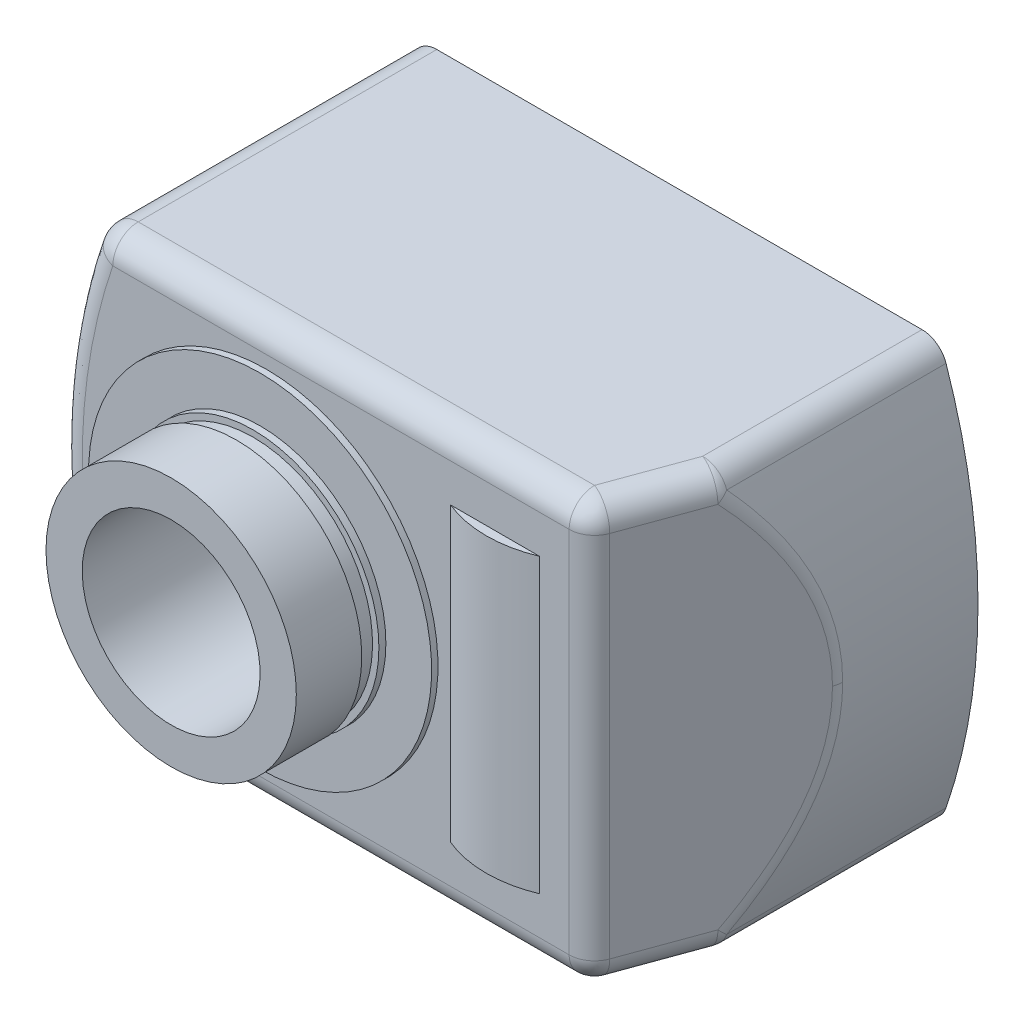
ISO-10303-21;
HEADER;
FILE_DESCRIPTION(('STEP AP214'),'2;1');
FILE_NAME('part.step','',(''),(''),'','','');
FILE_SCHEMA(('AUTOMOTIVE_DESIGN { 1 0 10303 214 1 1 1 1 }'));
ENDSEC;
DATA;
#1=APPLICATION_CONTEXT('core data for automotive mechanical design processes');
#2=APPLICATION_PROTOCOL_DEFINITION('international standard','automotive_design',2000,#1);
#3=PRODUCT_CONTEXT('',#1,'mechanical');
#4=PRODUCT('Part','Part','',(#3));
#5=PRODUCT_RELATED_PRODUCT_CATEGORY('part','',(#4));
#6=PRODUCT_DEFINITION_FORMATION('','',#4);
#7=PRODUCT_DEFINITION_CONTEXT('part definition',#1,'design');
#8=PRODUCT_DEFINITION('design','',#6,#7);
#9=PRODUCT_DEFINITION_SHAPE('','',#8);
#10=(LENGTH_UNIT() NAMED_UNIT(*) SI_UNIT(.MILLI.,.METRE.));
#11=(NAMED_UNIT(*) PLANE_ANGLE_UNIT() SI_UNIT($,.RADIAN.));
#12=(NAMED_UNIT(*) SI_UNIT($,.STERADIAN.) SOLID_ANGLE_UNIT());
#13=UNCERTAINTY_MEASURE_WITH_UNIT(LENGTH_MEASURE(1.E-05),#10,'distance_accuracy_value','');
#14=(GEOMETRIC_REPRESENTATION_CONTEXT(3) GLOBAL_UNCERTAINTY_ASSIGNED_CONTEXT((#13)) GLOBAL_UNIT_ASSIGNED_CONTEXT((#10,
#11,#12)) REPRESENTATION_CONTEXT('',''));
#15=CARTESIAN_POINT('',(0.,0.,0.));
#16=DIRECTION('',(0.,0.,1.));
#17=DIRECTION('',(1.,0.,0.));
#18=AXIS2_PLACEMENT_3D('',#15,#16,#17);
#19=CARTESIAN_POINT('',(26.073969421,-16.499911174,15.261022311));
#20=CARTESIAN_POINT('',(27.263075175,-16.511118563,15.261022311));
#21=CARTESIAN_POINT('',(28.103937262,-15.670256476,15.261022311));
#22=CARTESIAN_POINT('',(28.092729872,-14.481150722,15.261022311));
#23=CARTESIAN_POINT('',(26.073969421,-16.499911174,15.496340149));
#24=CARTESIAN_POINT('',(27.263075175,-16.511118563,15.496340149));
#25=CARTESIAN_POINT('',(28.103937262,-15.670256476,15.496340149));
#26=CARTESIAN_POINT('',(28.092729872,-14.481150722,15.496340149));
#27=CARTESIAN_POINT('',(26.074356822,-16.458807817,15.728040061));
#28=CARTESIAN_POINT('',(27.239023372,-16.469784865,15.728040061));
#29=CARTESIAN_POINT('',(28.062603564,-15.646204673,15.728040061));
#30=CARTESIAN_POINT('',(28.051626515,-14.481538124,15.728040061));
#31=CARTESIAN_POINT('',(26.075119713,-16.377865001,15.948997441));
#32=CARTESIAN_POINT('',(27.191659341,-16.388388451,15.948997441));
#33=CARTESIAN_POINT('',(27.981207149,-15.598840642,15.948997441));
#34=CARTESIAN_POINT('',(27.970683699,-14.482301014,15.948997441));
#35=(BOUNDED_SURFACE() B_SPLINE_SURFACE(3,3,((#19,#20,#21,#22),(#23,#24,#25,#26),(#27,#28,#29,
#30),(#31,#32,#33,#34)),.UNSPECIFIED.,.F.,.F.,.F.) B_SPLINE_SURFACE_WITH_KNOTS((4,4),(4,4),(0.,
1.),(0.,1.),.UNSPECIFIED.) GEOMETRIC_REPRESENTATION_ITEM() RATIONAL_B_SPLINE_SURFACE(((1.,
0.800274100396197,0.800274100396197,1.),(0.98975024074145,0.792071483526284,0.792071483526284,
0.98975024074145),(0.98975024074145,0.792071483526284,0.792071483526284,0.98975024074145),(1.,
0.800274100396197,0.800274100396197,1.))) REPRESENTATION_ITEM('') SURFACE());
#36=CARTESIAN_POINT('',(26.0928186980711,-14.5,15.2610223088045));
#37=DIRECTION('',(-0.342020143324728,0.,0.939692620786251));
#38=DIRECTION('',(-0.939692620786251,0.,-0.342020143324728));
#39=AXIS2_PLACEMENT_3D('',#36,#37,#38);
#40=CIRCLE('',#39,1.99999999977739);
#41=CARTESIAN_POINT('',(27.9722039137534,-14.5000000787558,15.9450626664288));
#42=VERTEX_POINT('',#41);
#43=CARTESIAN_POINT('',(26.0928186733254,-16.4999999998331,15.2610222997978));
#44=VERTEX_POINT('',#43);
#45=EDGE_CURVE('E109',#42,#44,#40,.F.);
#46=CARTESIAN_POINT('',(26.092818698,-14.5,15.2610222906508));
#47=DIRECTION('',(0.,0.,-1.));
#48=DIRECTION('',(0.,1.,0.));
#49=AXIS2_PLACEMENT_3D('',#46,#47,#48);
#50=CIRCLE('',#49,2.);
#51=CARTESIAN_POINT('',(27.9855347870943,-15.1462397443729,15.2610223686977));
#52=VERTEX_POINT('',#51);
#53=EDGE_CURVE('E111',#44,#52,#50,.F.);
#54=CARTESIAN_POINT('',(27.9722039,-14.500000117,15.945062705));
#55=CARTESIAN_POINT('',(28.010529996,-14.611866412,15.839762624));
#56=CARTESIAN_POINT('',(28.03110215,-14.723726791,15.728006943));
#57=CARTESIAN_POINT('',(28.033344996,-14.832452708,15.612921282));
#58=CARTESIAN_POINT('',(28.035587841,-14.941178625,15.49783562));
#59=CARTESIAN_POINT('',(28.01950114,-15.046758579,15.379432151));
#60=CARTESIAN_POINT('',(27.985534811,-15.146239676,15.261022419));
#61=B_SPLINE_CURVE_WITH_KNOTS('',3,(#54,#55,#56,#57,#58,#59,#60),.UNSPECIFIED.,.F.,.F.,(4,3,4),
(0.,0.5,1.),.UNSPECIFIED.);
#62=EDGE_CURVE('E112',#42,#52,#61,.T.);
#63=ORIENTED_EDGE('',*,*,#45,.T.);
#64=ORIENTED_EDGE('',*,*,#53,.T.);
#65=ORIENTED_EDGE('',*,*,#62,.F.);
#66=EDGE_LOOP('',(#63,#64,#65));
#67=FACE_BOUND('',#66,.T.);
#68=ADVANCED_FACE('F14',(#67),#35,.F.);
#69=CARTESIAN_POINT('',(0.,0.,31.));
#70=DIRECTION('',(0.,0.,-1.));
#71=DIRECTION('',(0.,1.,0.));
#72=AXIS2_PLACEMENT_3D('',#69,#70,#71);
#73=CYLINDRICAL_SURFACE('',#72,7.);
#74=CARTESIAN_POINT('',(0.,0.,31.));
#75=DIRECTION('',(0.,0.,-1.));
#76=DIRECTION('',(0.,1.,0.));
#77=AXIS2_PLACEMENT_3D('',#74,#75,#76);
#78=CIRCLE('',#77,7.);
#79=CARTESIAN_POINT('',(0.,7.,31.));
#80=VERTEX_POINT('',#79);
#81=EDGE_CURVE('E129',#80,#80,#78,.T.);
#82=ORIENTED_EDGE('',*,*,#81,.F.);
#83=EDGE_LOOP('',(#82));
#84=FACE_BOUND('',#83,.T.);
#85=CARTESIAN_POINT('',(0.,0.,-2.));
#86=DIRECTION('',(0.,0.,-1.));
#87=DIRECTION('',(-1.,0.,0.));
#88=AXIS2_PLACEMENT_3D('',#85,#86,#87);
#89=CIRCLE('',#88,7.);
#90=CARTESIAN_POINT('',(-7.,0.,-2.));
#91=VERTEX_POINT('',#90);
#92=EDGE_CURVE('E591',#91,#91,#89,.T.);
#93=ORIENTED_EDGE('',*,*,#92,.T.);
#94=EDGE_LOOP('',(#93));
#95=FACE_BOUND('',#94,.T.);
#96=ADVANCED_FACE('F360',(#84,#95),#73,.F.);
#97=CARTESIAN_POINT('',(-16.375,0.,15.352588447));
#98=DIRECTION('',(0.,0.,-1.));
#99=DIRECTION('',(0.,1.,0.));
#100=AXIS2_PLACEMENT_3D('',#97,#98,#99);
#101=CYLINDRICAL_SURFACE('',#100,46.875);
#102=CARTESIAN_POINT('',(30.5,0.,8.647346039));
#103=CARTESIAN_POINT('',(30.5,1.285250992,8.647346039));
#104=CARTESIAN_POINT('',(30.447110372,2.570501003,8.786459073));
#105=CARTESIAN_POINT('',(30.341509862,3.851406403,9.064214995));
#106=CARTESIAN_POINT('',(30.235909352,5.132311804,9.341970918));
#107=CARTESIAN_POINT('',(30.077598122,6.408870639,9.758369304));
#108=CARTESIAN_POINT('',(29.867111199,7.67676865,10.312002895));
#109=CARTESIAN_POINT('',(29.656624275,8.944666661,10.865636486));
#110=CARTESIAN_POINT('',(29.393961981,10.203901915,11.556504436));
#111=CARTESIAN_POINT('',(29.080012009,11.450218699,12.382271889));
#112=CARTESIAN_POINT('',(28.766062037,12.696535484,13.208039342));
#113=CARTESIAN_POINT('',(28.400824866,13.929931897,14.168705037));
#114=CARTESIAN_POINT('',(27.985534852,15.146239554,15.261022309));
#115=CARTESIAN_POINT('',(27.968923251,15.19489186,15.304715));
#116=CARTESIAN_POINT('',(27.952311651,15.243544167,15.348407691));
#117=CARTESIAN_POINT('',(27.93570005,15.292196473,15.392100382));
#118=B_SPLINE_CURVE_WITH_KNOTS('',3,(#102,#103,#104,#105,#106,#107,#108,#109,#110,#111,#112,
#113,#114,#115,#116,#117),.UNSPECIFIED.,.F.,.F.,(4,3,3,3,3,4),(0.,0.0822560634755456,
0.164512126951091,0.246768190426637,0.329024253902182,0.332314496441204),.UNSPECIFIED.);
#119=CARTESIAN_POINT('',(30.5,1.40302644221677E-09,8.64734603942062));
#120=VERTEX_POINT('',#119);
#121=CARTESIAN_POINT('',(27.9855348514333,15.1462395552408,15.2610223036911));
#122=VERTEX_POINT('',#121);
#123=EDGE_CURVE('E116',#120,#122,#118,.T.);
#124=ORIENTED_EDGE('',*,*,#123,.F.);
#125=CARTESIAN_POINT('',(27.985534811,-15.146239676,15.261022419));
#126=CARTESIAN_POINT('',(28.400824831,-13.92993201,14.168705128));
#127=CARTESIAN_POINT('',(28.766062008,-12.696535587,13.208039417));
#128=CARTESIAN_POINT('',(29.080011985,-11.450218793,12.382271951));
#129=CARTESIAN_POINT('',(29.393961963,-10.203901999,11.556504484));
#130=CARTESIAN_POINT('',(29.656624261,-8.944666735,10.865636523));
#131=CARTESIAN_POINT('',(29.867111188,-7.676768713,10.312002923));
#132=CARTESIAN_POINT('',(30.077598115,-6.408870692,9.758369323));
#133=CARTESIAN_POINT('',(30.235909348,-5.132311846,9.341970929));
#134=CARTESIAN_POINT('',(30.34150986,-3.851406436,9.064215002));
#135=CARTESIAN_POINT('',(30.447110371,-2.570501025,8.786459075));
#136=CARTESIAN_POINT('',(30.5,-1.285251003,8.647346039));
#137=CARTESIAN_POINT('',(30.5,0.,8.647346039));
#138=B_SPLINE_CURVE_WITH_KNOTS('',3,(#125,#126,#127,#128,#129,#130,#131,#132,#133,#134,#135,
#136,#137),.UNSPECIFIED.,.F.,.F.,(4,3,3,3,4),(5.95416105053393,6.03641711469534,
6.11867317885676,6.20092924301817,6.28318530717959),.UNSPECIFIED.);
#139=EDGE_CURVE('E103',#52,#120,#138,.T.);
#140=ORIENTED_EDGE('',*,*,#139,.F.);
#141=DIRECTION('',(0.,0.,1.));
#142=VECTOR('',#141,1.);
#143=CARTESIAN_POINT('',(27.9855347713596,-15.1462397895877,7.630511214));
#144=LINE('',#143,#142);
#145=CARTESIAN_POINT('',(27.985534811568,-15.1462396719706,-2.));
#146=VERTEX_POINT('',#145);
#147=EDGE_CURVE('E128',#52,#146,#144,.F.);
#148=ORIENTED_EDGE('',*,*,#147,.T.);
#149=CARTESIAN_POINT('',(-16.375,0.,-2.));
#150=DIRECTION('',(0.,0.,-1.));
#151=DIRECTION('',(-1.,0.,0.));
#152=AXIS2_PLACEMENT_3D('',#149,#150,#151);
#153=CIRCLE('',#152,46.8749999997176);
#154=CARTESIAN_POINT('',(27.9855348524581,15.1462395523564,-2.));
#155=VERTEX_POINT('',#154);
#156=EDGE_CURVE('E603',#155,#146,#153,.T.);
#157=ORIENTED_EDGE('',*,*,#156,.F.);
#158=DIRECTION('',(0.,0.,-1.));
#159=VECTOR('',#158,1.);
#160=CARTESIAN_POINT('',(27.9855348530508,15.146239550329,7.630511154));
#161=LINE('',#160,#159);
#162=EDGE_CURVE('E162',#155,#122,#161,.F.);
#163=ORIENTED_EDGE('',*,*,#162,.T.);
#164=EDGE_LOOP('',(#124,#140,#148,#157,#163));
#165=FACE_BOUND('',#164,.T.);
#166=ADVANCED_FACE('F330',(#165),#101,.T.);
#167=CARTESIAN_POINT('',(28.092729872,14.481150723,15.26102229));
#168=CARTESIAN_POINT('',(28.103937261,15.670256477,15.26102229));
#169=CARTESIAN_POINT('',(27.263075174,16.511118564,15.26102229));
#170=CARTESIAN_POINT('',(26.073969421,16.499911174,15.26102229));
#171=CARTESIAN_POINT('',(28.092729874,14.481150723,15.496340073));
#172=CARTESIAN_POINT('',(28.103937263,15.670256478,15.496340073));
#173=CARTESIAN_POINT('',(27.263075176,16.511118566,15.496340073));
#174=CARTESIAN_POINT('',(26.073969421,16.499911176,15.496340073));
#175=CARTESIAN_POINT('',(28.051626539,14.481538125,15.728039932));
#176=CARTESIAN_POINT('',(28.062603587,15.646204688,15.728039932));
#177=CARTESIAN_POINT('',(27.239023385,16.46978489,15.728039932));
#178=CARTESIAN_POINT('',(26.074356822,16.458807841,15.728039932));
#179=CARTESIAN_POINT('',(27.970683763,14.482301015,15.948997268));
#180=CARTESIAN_POINT('',(27.981207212,15.59884068,15.948997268));
#181=CARTESIAN_POINT('',(27.191659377,16.388388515,15.948997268));
#182=CARTESIAN_POINT('',(26.075119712,16.377865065,15.948997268));
#183=(BOUNDED_SURFACE() B_SPLINE_SURFACE(3,3,((#167,#168,#169,#170),(#171,#172,#173,#174),(#175,
#176,#177,#178),(#179,#180,#181,#182)),.UNSPECIFIED.,.F.,.F.,
.F.) B_SPLINE_SURFACE_WITH_KNOTS((4,4),(4,4),(0.,1.),(0.,1.),
.UNSPECIFIED.) GEOMETRIC_REPRESENTATION_ITEM() RATIONAL_B_SPLINE_SURFACE(((1.,0.800274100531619,
0.800274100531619,1.),(0.989750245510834,0.792071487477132,0.792071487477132,0.989750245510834),
(0.989750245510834,0.792071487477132,0.792071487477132,0.989750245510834),(1.,0.800274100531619,
0.800274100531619,1.))) REPRESENTATION_ITEM('') SURFACE());
#184=CARTESIAN_POINT('',(27.9855348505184,15.1462395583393,15.2610223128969));
#185=CARTESIAN_POINT('',(28.0195011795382,15.046758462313,15.3794320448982));
#186=CARTESIAN_POINT('',(28.0355878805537,14.9411785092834,15.4978355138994));
#187=CARTESIAN_POINT('',(28.0333450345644,14.832452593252,15.6129211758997));
#188=CARTESIAN_POINT('',(28.031102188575,14.7237266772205,15.7280068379));
#189=CARTESIAN_POINT('',(28.0105300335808,14.6118662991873,15.8397625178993));
#190=CARTESIAN_POINT('',(27.9722039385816,14.5000000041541,15.9450625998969));
#191=B_SPLINE_CURVE_WITH_KNOTS('',3,(#184,#185,#186,#187,#188,#189,#190),.UNSPECIFIED.,.F.,.F.,
(4,3,4),(0.,0.5,1.),.UNSPECIFIED.);
#192=CARTESIAN_POINT('',(27.9722039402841,14.5000000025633,15.9450625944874));
#193=VERTEX_POINT('',#192);
#194=EDGE_CURVE('E728',#122,#193,#191,.T.);
#195=CARTESIAN_POINT('',(26.092818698,14.5,15.261022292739));
#196=DIRECTION('',(0.,0.,-1.));
#197=DIRECTION('',(0.,1.,0.));
#198=AXIS2_PLACEMENT_3D('',#195,#196,#197);
#199=CIRCLE('',#198,2.);
#200=CARTESIAN_POINT('',(26.0928186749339,16.500000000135,15.2610223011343));
#201=VERTEX_POINT('',#200);
#202=EDGE_CURVE('E76',#122,#201,#199,.F.);
#203=CARTESIAN_POINT('',(26.0928186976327,14.5,15.2610223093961));
#204=DIRECTION('',(0.342020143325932,0.,-0.939692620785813));
#205=DIRECTION('',(0.939692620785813,0.,0.342020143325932));
#206=AXIS2_PLACEMENT_3D('',#203,#204,#205);
#207=CIRCLE('',#206,2.00000000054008);
#208=EDGE_CURVE('E165',#201,#193,#207,.T.);
#209=ORIENTED_EDGE('',*,*,#194,.F.);
#210=ORIENTED_EDGE('',*,*,#202,.T.);
#211=ORIENTED_EDGE('',*,*,#208,.T.);
#212=EDGE_LOOP('',(#209,#210,#211));
#213=FACE_BOUND('',#212,.T.);
#214=ADVANCED_FACE('F322',(#213),#183,.F.);
#215=CARTESIAN_POINT('',(-10.0188,10.0188,31.));
#216=DIRECTION('',(0.,0.,1.));
#217=DIRECTION('',(0.,-1.,0.));
#218=AXIS2_PLACEMENT_3D('',#215,#216,#217);
#219=PLANE('',#218);
#220=CARTESIAN_POINT('',(0.,0.,31.));
#221=DIRECTION('',(0.,0.,-1.));
#222=DIRECTION('',(0.,1.,0.));
#223=AXIS2_PLACEMENT_3D('',#220,#221,#222);
#224=CIRCLE('',#223,9.85);
#225=CARTESIAN_POINT('',(0.,9.85,31.));
#226=VERTEX_POINT('',#225);
#227=EDGE_CURVE('E335',#226,#226,#224,.T.);
#228=ORIENTED_EDGE('',*,*,#227,.F.);
#229=EDGE_LOOP('',(#228));
#230=FACE_BOUND('',#229,.T.);
#231=ORIENTED_EDGE('',*,*,#81,.T.);
#232=EDGE_LOOP('',(#231));
#233=FACE_BOUND('',#232,.T.);
#234=ADVANCED_FACE('F320',(#230,#233),#219,.T.);
#235=CARTESIAN_POINT('',(26.092818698,-14.5,15.261022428));
#236=DIRECTION('',(0.,0.,-1.));
#237=DIRECTION('',(1.,0.,0.));
#238=AXIS2_PLACEMENT_3D('',#235,#236,#237);
#239=CYLINDRICAL_SURFACE('',#238,2.);
#240=DIRECTION('',(0.,0.,-1.));
#241=VECTOR('',#240,1.);
#242=CARTESIAN_POINT('',(26.092818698,-16.5,10.75));
#243=LINE('',#242,#241);
#244=CARTESIAN_POINT('',(26.092818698,-16.5,-2.));
#245=VERTEX_POINT('',#244);
#246=EDGE_CURVE('E125',#44,#245,#243,.T.);
#247=ORIENTED_EDGE('',*,*,#246,.T.);
#248=CARTESIAN_POINT('',(26.092818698,-14.5,-2.));
#249=DIRECTION('',(0.,0.,-1.));
#250=DIRECTION('',(-1.,0.,0.));
#251=AXIS2_PLACEMENT_3D('',#248,#249,#250);
#252=CIRCLE('',#251,2.00000000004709);
#253=EDGE_CURVE('E606',#146,#245,#252,.T.);
#254=ORIENTED_EDGE('',*,*,#253,.F.);
#255=ORIENTED_EDGE('',*,*,#147,.F.);
#256=ORIENTED_EDGE('',*,*,#53,.F.);
#257=EDGE_LOOP('',(#247,#254,#255,#256));
#258=FACE_BOUND('',#257,.T.);
#259=ADVANCED_FACE('F121',(#258),#239,.T.);
#260=CARTESIAN_POINT('',(-12.092818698,-14.5,21.5));
#261=DIRECTION('',(0.,0.,-1.));
#262=DIRECTION('',(1.,0.,0.));
#263=AXIS2_PLACEMENT_3D('',#260,#261,#262);
#264=CYLINDRICAL_SURFACE('',#263,2.);
#265=DIRECTION('',(0.,0.,1.));
#266=VECTOR('',#265,1.);
#267=CARTESIAN_POINT('',(-13.9855348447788,-15.1462395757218,10.75));
#268=LINE('',#267,#266);
#269=CARTESIAN_POINT('',(-13.9855348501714,-15.1462395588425,21.5));
#270=VERTEX_POINT('',#269);
#271=CARTESIAN_POINT('',(-13.9855348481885,-15.1462395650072,-2.));
#272=VERTEX_POINT('',#271);
#273=EDGE_CURVE('E148',#270,#272,#268,.F.);
#274=ORIENTED_EDGE('',*,*,#273,.T.);
#275=CARTESIAN_POINT('',(-12.092818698,-14.5,-2.));
#276=DIRECTION('',(0.,0.,-1.));
#277=DIRECTION('',(-1.,0.,0.));
#278=AXIS2_PLACEMENT_3D('',#275,#276,#277);
#279=CIRCLE('',#278,2.00000000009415);
#280=CARTESIAN_POINT('',(-12.092818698,-16.5000000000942,-2.));
#281=VERTEX_POINT('',#280);
#282=EDGE_CURVE('E588',#281,#272,#279,.T.);
#283=ORIENTED_EDGE('',*,*,#282,.F.);
#284=DIRECTION('',(0.,0.,1.));
#285=VECTOR('',#284,1.);
#286=CARTESIAN_POINT('',(-12.092818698,-16.5,10.75));
#287=LINE('',#286,#285);
#288=CARTESIAN_POINT('',(-12.0928187,-16.5,21.5000000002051));
#289=VERTEX_POINT('',#288);
#290=EDGE_CURVE('E141',#281,#289,#287,.T.);
#291=ORIENTED_EDGE('',*,*,#290,.T.);
#292=CARTESIAN_POINT('',(-12.092818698,-14.5,21.5));
#293=DIRECTION('',(0.,0.,-1.));
#294=DIRECTION('',(1.,0.,0.));
#295=AXIS2_PLACEMENT_3D('',#292,#293,#294);
#296=CIRCLE('',#295,2.);
#297=EDGE_CURVE('E140',#289,#270,#296,.T.);
#298=ORIENTED_EDGE('',*,*,#297,.T.);
#299=EDGE_LOOP('',(#274,#283,#291,#298));
#300=FACE_BOUND('',#299,.T.);
#301=ADVANCED_FACE('F328',(#300),#264,.T.);
#302=CARTESIAN_POINT('',(27.985534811,-15.146239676,15.261022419));
#303=CARTESIAN_POINT('',(28.01950114,-15.046758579,15.379432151));
#304=CARTESIAN_POINT('',(28.035587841,-14.941178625,15.49783562));
#305=CARTESIAN_POINT('',(28.033344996,-14.832452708,15.612921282));
#306=CARTESIAN_POINT('',(28.03110215,-14.723726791,15.728006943));
#307=CARTESIAN_POINT('',(28.010529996,-14.611866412,15.839762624));
#308=CARTESIAN_POINT('',(27.9722039,-14.500000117,15.945062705));
#309=CARTESIAN_POINT('',(28.400824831,-13.92993201,14.168705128));
#310=CARTESIAN_POINT('',(28.429236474,-13.837799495,14.286768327));
#311=CARTESIAN_POINT('',(28.440978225,-13.740527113,14.40482624));
#312=CARTESIAN_POINT('',(28.435755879,-13.640610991,14.519828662));
#313=CARTESIAN_POINT('',(28.430533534,-13.540694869,14.634831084));
#314=CARTESIAN_POINT('',(28.408347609,-13.438143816,14.746767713));
#315=CARTESIAN_POINT('',(28.36977488,-13.335588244,14.852745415));
#316=CARTESIAN_POINT('',(28.766062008,-12.696535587,13.208039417));
#317=CARTESIAN_POINT('',(28.789561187,-12.612100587,13.325801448));
#318=CARTESIAN_POINT('',(28.797484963,-12.523319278,13.443558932));
#319=CARTESIAN_POINT('',(28.789648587,-12.432306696,13.558488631));
#320=CARTESIAN_POINT('',(28.78181221,-12.341294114,13.67341833));
#321=CARTESIAN_POINT('',(28.758216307,-12.248057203,13.785511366));
#322=CARTESIAN_POINT('',(28.719428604,-12.154816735,13.892079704));
#323=CARTESIAN_POINT('',(29.080011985,-11.450218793,12.382271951));
#324=CARTESIAN_POINT('',(29.099275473,-11.37374671,12.499776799));
#325=CARTESIAN_POINT('',(29.103919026,-11.29359458,12.617277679));
#326=CARTESIAN_POINT('',(29.093838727,-11.211556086,12.732145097));
#327=CARTESIAN_POINT('',(29.083758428,-11.129517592,12.847012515));
#328=CARTESIAN_POINT('',(29.058954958,-11.045598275,12.959238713));
#329=CARTESIAN_POINT('',(29.019983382,-10.961676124,13.066312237));
#330=CARTESIAN_POINT('',(29.393961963,-10.203901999,11.556504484));
#331=CARTESIAN_POINT('',(29.40898976,-10.135392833,11.673752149));
#332=CARTESIAN_POINT('',(29.410353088,-10.063869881,11.790996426));
#333=CARTESIAN_POINT('',(29.398028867,-9.990805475,11.905801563));
#334=CARTESIAN_POINT('',(29.385704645,-9.917741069,12.0206067));
#335=CARTESIAN_POINT('',(29.359693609,-9.843139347,12.13296606));
#336=CARTESIAN_POINT('',(29.320538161,-9.768535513,12.240544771));
#337=CARTESIAN_POINT('',(29.656624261,-8.944666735,10.865636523));
#338=CARTESIAN_POINT('',(29.668093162,-8.884385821,10.982670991));
#339=CARTESIAN_POINT('',(29.666714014,-8.821630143,11.09970249));
#340=CARTESIAN_POINT('',(29.65251598,-8.757610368,11.214455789));
#341=CARTESIAN_POINT('',(29.638317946,-8.693590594,11.329209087));
#342=CARTESIAN_POINT('',(29.611301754,-8.628309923,11.441678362));
#343=CARTESIAN_POINT('',(29.571993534,-8.563027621,11.549676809));
#344=CARTESIAN_POINT('',(29.867111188,-7.676768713,10.312002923));
#345=CARTESIAN_POINT('',(29.875722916,-7.62489474,10.428867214));
#346=CARTESIAN_POINT('',(29.872146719,-7.57099863,10.545728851));
#347=CARTESIAN_POINT('',(29.856448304,-7.516070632,10.6604407));
#348=CARTESIAN_POINT('',(29.840749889,-7.461142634,10.775152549));
#349=CARTESIAN_POINT('',(29.812929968,-7.405185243,10.887709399));
#350=CARTESIAN_POINT('',(29.773499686,-7.349226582,10.996043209));
#351=CARTESIAN_POINT('',(30.077598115,-6.408870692,9.758369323));
#352=CARTESIAN_POINT('',(30.08335267,-6.36540366,9.875063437));
#353=CARTESIAN_POINT('',(30.077579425,-6.320367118,9.991755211));
#354=CARTESIAN_POINT('',(30.060380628,-6.274530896,10.106425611));
#355=CARTESIAN_POINT('',(30.043181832,-6.228694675,10.22109601));
#356=CARTESIAN_POINT('',(30.014558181,-6.182060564,10.333740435));
#357=CARTESIAN_POINT('',(29.975005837,-6.135425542,10.442409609));
#358=CARTESIAN_POINT('',(30.235909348,-5.132311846,9.341970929));
#359=CARTESIAN_POINT('',(30.239508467,-5.097430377,9.458537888));
#360=CARTESIAN_POINT('',(30.232083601,-5.061345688,9.575102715));
#361=CARTESIAN_POINT('',(30.213757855,-5.024648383,9.689742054));
#362=CARTESIAN_POINT('',(30.195432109,-4.987951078,9.804381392));
#363=CARTESIAN_POINT('',(30.166206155,-4.950642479,9.917091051));
#364=CARTESIAN_POINT('',(30.126562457,-4.913333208,10.026011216));
#365=CARTESIAN_POINT('',(30.34150986,-3.851406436,9.064215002));
#366=CARTESIAN_POINT('',(30.343670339,-3.825200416,9.180697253));
#367=CARTESIAN_POINT('',(30.335143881,-3.798113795,9.297177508));
#368=CARTESIAN_POINT('',(30.316066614,-3.770579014,9.411796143));
#369=CARTESIAN_POINT('',(30.296989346,-3.743044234,9.526414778));
#370=CARTESIAN_POINT('',(30.267361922,-3.715062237,9.639167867));
#371=CARTESIAN_POINT('',(30.227657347,-3.687079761,9.748255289));
#372=CARTESIAN_POINT('',(30.447110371,-2.570501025,8.786459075));
#373=CARTESIAN_POINT('',(30.44783221,-2.552970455,8.902856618));
#374=CARTESIAN_POINT('',(30.438204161,-2.534881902,9.019252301));
#375=CARTESIAN_POINT('',(30.418375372,-2.516509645,9.133850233));
#376=CARTESIAN_POINT('',(30.398546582,-2.498137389,9.248448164));
#377=CARTESIAN_POINT('',(30.368517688,-2.479481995,9.361244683));
#378=CARTESIAN_POINT('',(30.328752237,-2.460826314,9.470499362));
#379=CARTESIAN_POINT('',(30.5,-1.285251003,8.647346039));
#380=CARTESIAN_POINT('',(30.5,-1.2764857,8.763701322));
#381=CARTESIAN_POINT('',(30.489820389,-1.267441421,8.880054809));
#382=CARTESIAN_POINT('',(30.469615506,-1.258255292,8.994642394));
#383=CARTESIAN_POINT('',(30.449410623,-1.249069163,9.109229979));
#384=CARTESIAN_POINT('',(30.419181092,-1.239741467,9.222048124));
#385=CARTESIAN_POINT('',(30.379385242,-1.230413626,9.331386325));
#386=CARTESIAN_POINT('',(30.5,0.,8.647346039));
#387=CARTESIAN_POINT('',(30.5,0.,8.763701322));
#388=CARTESIAN_POINT('',(30.489820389,0.,8.880054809));
#389=CARTESIAN_POINT('',(30.469615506,0.,8.994642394));
#390=CARTESIAN_POINT('',(30.449410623,0.,9.109229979));
#391=CARTESIAN_POINT('',(30.419181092,0.,9.222048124));
#392=CARTESIAN_POINT('',(30.379385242,0.,9.331386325));
#393=B_SPLINE_SURFACE_WITH_KNOTS('',3,3,((#302,#303,#304,#305,#306,#307,#308),(#309,#310,#311,
#312,#313,#314,#315),(#316,#317,#318,#319,#320,#321,#322),(#323,#324,#325,#326,#327,#328,#329),
(#330,#331,#332,#333,#334,#335,#336),(#337,#338,#339,#340,#341,#342,#343),(#344,#345,#346,#347,
#348,#349,#350),(#351,#352,#353,#354,#355,#356,#357),(#358,#359,#360,#361,#362,#363,#364),(#365,
#366,#367,#368,#369,#370,#371),(#372,#373,#374,#375,#376,#377,#378),(#379,#380,#381,#382,#383,
#384,#385),(#386,#387,#388,#389,#390,#391,#392)),.UNSPECIFIED.,.F.,.F.,.F.,(4,3,3,3,4),(4,3,4),
(5.95416105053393,6.03641711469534,6.11867317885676,6.20092924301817,6.28318530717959),(0.,0.5,
1.),.UNSPECIFIED.);
#394=CARTESIAN_POINT('',(30.5,0.,8.647346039));
#395=CARTESIAN_POINT('',(30.5,0.,8.763701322));
#396=CARTESIAN_POINT('',(30.489820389,0.,8.880054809));
#397=CARTESIAN_POINT('',(30.469615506,0.,8.994642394));
#398=CARTESIAN_POINT('',(30.449410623,0.,9.109229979));
#399=CARTESIAN_POINT('',(30.419181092,0.,9.222048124));
#400=CARTESIAN_POINT('',(30.379385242,0.,9.331386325));
#401=B_SPLINE_CURVE_WITH_KNOTS('',3,(#394,#395,#396,#397,#398,#399,#400),.UNSPECIFIED.,.F.,.F.,
(4,3,4),(0.,0.5,1.),.UNSPECIFIED.);
#402=CARTESIAN_POINT('',(30.3793852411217,5.99999563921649E-10,9.33138632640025));
#403=VERTEX_POINT('',#402);
#404=EDGE_CURVE('E87',#403,#120,#401,.F.);
#405=CARTESIAN_POINT('',(30.379385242,0.,9.331386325));
#406=CARTESIAN_POINT('',(30.379385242,-1.230413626,9.331386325));
#407=CARTESIAN_POINT('',(30.328752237,-2.460826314,9.470499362));
#408=CARTESIAN_POINT('',(30.227657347,-3.687079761,9.748255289));
#409=CARTESIAN_POINT('',(30.126562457,-4.913333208,10.026011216));
#410=CARTESIAN_POINT('',(29.975005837,-6.135425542,10.442409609));
#411=CARTESIAN_POINT('',(29.773499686,-7.349226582,10.996043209));
#412=CARTESIAN_POINT('',(29.571993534,-8.563027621,11.549676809));
#413=CARTESIAN_POINT('',(29.320538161,-9.768535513,12.240544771));
#414=CARTESIAN_POINT('',(29.019983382,-10.961676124,13.066312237));
#415=CARTESIAN_POINT('',(28.719428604,-12.154816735,13.892079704));
#416=CARTESIAN_POINT('',(28.36977488,-13.335588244,14.852745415));
#417=CARTESIAN_POINT('',(27.9722039,-14.500000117,15.945062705));
#418=B_SPLINE_CURVE_WITH_KNOTS('',3,(#405,#406,#407,#408,#409,#410,#411,#412,#413,#414,#415,
#416,#417),.UNSPECIFIED.,.F.,.F.,(4,3,3,3,4),(5.95416105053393,6.03641711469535,
6.11867317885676,6.20092924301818,6.28318530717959),.UNSPECIFIED.);
#419=EDGE_CURVE('E241',#42,#403,#418,.F.);
#420=ORIENTED_EDGE('',*,*,#139,.T.);
#421=ORIENTED_EDGE('',*,*,#404,.F.);
#422=ORIENTED_EDGE('',*,*,#419,.F.);
#423=ORIENTED_EDGE('',*,*,#62,.T.);
#424=EDGE_LOOP('',(#420,#421,#422,#423));
#425=FACE_BOUND('',#424,.T.);
#426=ADVANCED_FACE('F191',(#425),#393,.T.);
#427=CARTESIAN_POINT('',(30.5,0.,8.647346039));
#428=CARTESIAN_POINT('',(30.5,0.,8.763701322));
#429=CARTESIAN_POINT('',(30.489820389,0.,8.880054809));
#430=CARTESIAN_POINT('',(30.469615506,0.,8.994642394));
#431=CARTESIAN_POINT('',(30.449410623,0.,9.109229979));
#432=CARTESIAN_POINT('',(30.419181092,0.,9.222048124));
#433=CARTESIAN_POINT('',(30.379385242,0.,9.331386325));
#434=CARTESIAN_POINT('',(30.5,1.285250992,8.647346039));
#435=CARTESIAN_POINT('',(30.5,1.276485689,8.763701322));
#436=CARTESIAN_POINT('',(30.489820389,1.267441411,8.880054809));
#437=CARTESIAN_POINT('',(30.469615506,1.258255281,8.994642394));
#438=CARTESIAN_POINT('',(30.449410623,1.249069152,9.109229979));
#439=CARTESIAN_POINT('',(30.419181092,1.239741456,9.222048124));
#440=CARTESIAN_POINT('',(30.379385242,1.230413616,9.331386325));
#441=CARTESIAN_POINT('',(30.447110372,2.570501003,8.786459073));
#442=CARTESIAN_POINT('',(30.447832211,2.552970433,8.902856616));
#443=CARTESIAN_POINT('',(30.438204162,2.53488188,9.019252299));
#444=CARTESIAN_POINT('',(30.418375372,2.516509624,9.13385023));
#445=CARTESIAN_POINT('',(30.398546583,2.498137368,9.248448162));
#446=CARTESIAN_POINT('',(30.368517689,2.479481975,9.361244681));
#447=CARTESIAN_POINT('',(30.328752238,2.460826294,9.47049936));
#448=CARTESIAN_POINT('',(30.341509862,3.851406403,9.064214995));
#449=CARTESIAN_POINT('',(30.343670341,3.825200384,9.180697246));
#450=CARTESIAN_POINT('',(30.335143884,3.798113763,9.297177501));
#451=CARTESIAN_POINT('',(30.316066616,3.770578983,9.411796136));
#452=CARTESIAN_POINT('',(30.296989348,3.743044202,9.526414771));
#453=CARTESIAN_POINT('',(30.267361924,3.715062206,9.63916786));
#454=CARTESIAN_POINT('',(30.22765735,3.68707973,9.748255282));
#455=CARTESIAN_POINT('',(30.235909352,5.132311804,9.341970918));
#456=CARTESIAN_POINT('',(30.239508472,5.097430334,9.458537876));
#457=CARTESIAN_POINT('',(30.232083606,5.061345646,9.575102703));
#458=CARTESIAN_POINT('',(30.21375786,5.024648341,9.689742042));
#459=CARTESIAN_POINT('',(30.195432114,4.987951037,9.804381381));
#460=CARTESIAN_POINT('',(30.16620616,4.950642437,9.917091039));
#461=CARTESIAN_POINT('',(30.126562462,4.913333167,10.026011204));
#462=CARTESIAN_POINT('',(30.077598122,6.408870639,9.758369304));
#463=CARTESIAN_POINT('',(30.083352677,6.365403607,9.875063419));
#464=CARTESIAN_POINT('',(30.077579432,6.320367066,9.991755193));
#465=CARTESIAN_POINT('',(30.060380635,6.274530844,10.106425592));
#466=CARTESIAN_POINT('',(30.043181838,6.228694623,10.221095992));
#467=CARTESIAN_POINT('',(30.014558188,6.182060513,10.333740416));
#468=CARTESIAN_POINT('',(29.975005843,6.135425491,10.442409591));
#469=CARTESIAN_POINT('',(29.867111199,7.67676865,10.312002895));
#470=CARTESIAN_POINT('',(29.875722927,7.624894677,10.428867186));
#471=CARTESIAN_POINT('',(29.87214673,7.570998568,10.545728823));
#472=CARTESIAN_POINT('',(29.856448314,7.51607057,10.660440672));
#473=CARTESIAN_POINT('',(29.840749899,7.461142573,10.775152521));
#474=CARTESIAN_POINT('',(29.812929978,7.405185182,10.887709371));
#475=CARTESIAN_POINT('',(29.773499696,7.349226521,10.996043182));
#476=CARTESIAN_POINT('',(29.656624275,8.944666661,10.865636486));
#477=CARTESIAN_POINT('',(29.668093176,8.884385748,10.982670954));
#478=CARTESIAN_POINT('',(29.666714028,8.82163007,11.099702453));
#479=CARTESIAN_POINT('',(29.652515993,8.757610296,11.214455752));
#480=CARTESIAN_POINT('',(29.638317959,8.693590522,11.32920905));
#481=CARTESIAN_POINT('',(29.611301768,8.628309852,11.441678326));
#482=CARTESIAN_POINT('',(29.571993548,8.56302755,11.549676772));
#483=CARTESIAN_POINT('',(29.393961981,10.203901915,11.556504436));
#484=CARTESIAN_POINT('',(29.408989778,10.13539275,11.673752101));
#485=CARTESIAN_POINT('',(29.410353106,10.063869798,11.790996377));
#486=CARTESIAN_POINT('',(29.398028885,9.990805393,11.905801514));
#487=CARTESIAN_POINT('',(29.385704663,9.917740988,12.020606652));
#488=CARTESIAN_POINT('',(29.359693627,9.843139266,12.132966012));
#489=CARTESIAN_POINT('',(29.320538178,9.768535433,12.240544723));
#490=CARTESIAN_POINT('',(29.080012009,11.450218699,12.382271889));
#491=CARTESIAN_POINT('',(29.099275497,11.373746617,12.499776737));
#492=CARTESIAN_POINT('',(29.103919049,11.293594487,12.617277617));
#493=CARTESIAN_POINT('',(29.09383875,11.211555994,12.732145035));
#494=CARTESIAN_POINT('',(29.08375845,11.129517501,12.847012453));
#495=CARTESIAN_POINT('',(29.058954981,11.045598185,12.959238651));
#496=CARTESIAN_POINT('',(29.019983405,10.961676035,13.066312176));
#497=CARTESIAN_POINT('',(28.766062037,12.696535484,13.208039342));
#498=CARTESIAN_POINT('',(28.789561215,12.612100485,13.325801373));
#499=CARTESIAN_POINT('',(28.797484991,12.523319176,13.443558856));
#500=CARTESIAN_POINT('',(28.789648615,12.432306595,13.558488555));
#501=CARTESIAN_POINT('',(28.781812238,12.341294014,13.673418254));
#502=CARTESIAN_POINT('',(28.758216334,12.248057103,13.785511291));
#503=CARTESIAN_POINT('',(28.719428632,12.154816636,13.892079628));
#504=CARTESIAN_POINT('',(28.400824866,13.929931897,14.168705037));
#505=CARTESIAN_POINT('',(28.429236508,13.837799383,14.286768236));
#506=CARTESIAN_POINT('',(28.440978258,13.740527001,14.404826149));
#507=CARTESIAN_POINT('',(28.435755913,13.64061088,14.519828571));
#508=CARTESIAN_POINT('',(28.430533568,13.540694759,14.634830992));
#509=CARTESIAN_POINT('',(28.408347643,13.438143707,14.746767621));
#510=CARTESIAN_POINT('',(28.369774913,13.335588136,14.852745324));
#511=CARTESIAN_POINT('',(27.985534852,15.146239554,15.261022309));
#512=CARTESIAN_POINT('',(28.019501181,15.046758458,15.379432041));
#513=CARTESIAN_POINT('',(28.035587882,14.941178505,15.49783551));
#514=CARTESIAN_POINT('',(28.033345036,14.832452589,15.612921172));
#515=CARTESIAN_POINT('',(28.03110219,14.723726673,15.728006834));
#516=CARTESIAN_POINT('',(28.010530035,14.611866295,15.839762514));
#517=CARTESIAN_POINT('',(27.97220394,14.5,15.945062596));
#518=CARTESIAN_POINT('',(27.968923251,15.19489186,15.304715));
#519=CARTESIAN_POINT('',(28.003111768,15.095116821,15.423138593));
#520=CARTESIAN_POINT('',(28.019372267,14.989204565,15.541555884));
#521=CARTESIAN_POINT('',(28.017248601,14.880126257,15.656644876));
#522=CARTESIAN_POINT('',(28.015124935,14.77104795,15.771733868));
#523=CARTESIAN_POINT('',(27.994617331,14.658815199,15.88348231));
#524=CARTESIAN_POINT('',(27.956301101,14.546576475,15.988755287));
#525=CARTESIAN_POINT('',(27.952311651,15.243544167,15.348407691));
#526=CARTESIAN_POINT('',(27.986722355,15.143475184,15.466845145));
#527=CARTESIAN_POINT('',(28.003156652,15.037230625,15.585276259));
#528=CARTESIAN_POINT('',(28.001152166,14.927799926,15.70036858));
#529=CARTESIAN_POINT('',(27.99914768,14.818369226,15.815460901));
#530=CARTESIAN_POINT('',(27.978704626,14.705764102,15.927202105));
#531=CARTESIAN_POINT('',(27.940398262,14.593152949,16.032447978));
#532=CARTESIAN_POINT('',(27.93570005,15.292196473,15.392100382));
#533=CARTESIAN_POINT('',(27.970332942,15.191833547,15.510551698));
#534=CARTESIAN_POINT('',(27.986941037,15.085256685,15.628996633));
#535=CARTESIAN_POINT('',(27.985055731,14.975473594,15.744092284));
#536=CARTESIAN_POINT('',(27.983170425,14.865690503,15.859187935));
#537=CARTESIAN_POINT('',(27.962791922,14.752713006,15.970921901));
#538=CARTESIAN_POINT('',(27.924495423,14.639729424,16.076140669));
#539=B_SPLINE_SURFACE_WITH_KNOTS('',3,3,((#427,#428,#429,#430,#431,#432,#433),(#434,#435,#436,
#437,#438,#439,#440),(#441,#442,#443,#444,#445,#446,#447),(#448,#449,#450,#451,#452,#453,#454),
(#455,#456,#457,#458,#459,#460,#461),(#462,#463,#464,#465,#466,#467,#468),(#469,#470,#471,#472,
#473,#474,#475),(#476,#477,#478,#479,#480,#481,#482),(#483,#484,#485,#486,#487,#488,#489),(#490,
#491,#492,#493,#494,#495,#496),(#497,#498,#499,#500,#501,#502,#503),(#504,#505,#506,#507,#508,
#509,#510),(#511,#512,#513,#514,#515,#516,#517),(#518,#519,#520,#521,#522,#523,#524),(#525,#526,
#527,#528,#529,#530,#531),(#532,#533,#534,#535,#536,#537,#538)),.UNSPECIFIED.,.F.,.F.,.F.,(4,3,
3,3,3,4),(4,3,4),(0.,0.0822560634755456,0.164512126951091,0.246768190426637,0.329024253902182,
0.332314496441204),(0.,0.5,1.),.UNSPECIFIED.);
#540=CARTESIAN_POINT('',(27.924495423,14.639729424,16.076140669));
#541=CARTESIAN_POINT('',(27.940398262,14.593152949,16.032447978));
#542=CARTESIAN_POINT('',(27.956301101,14.546576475,15.988755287));
#543=CARTESIAN_POINT('',(27.97220394,14.5,15.945062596));
#544=CARTESIAN_POINT('',(28.369774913,13.335588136,14.852745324));
#545=CARTESIAN_POINT('',(28.719428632,12.154816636,13.892079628));
#546=CARTESIAN_POINT('',(29.019983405,10.961676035,13.066312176));
#547=CARTESIAN_POINT('',(29.320538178,9.768535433,12.240544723));
#548=CARTESIAN_POINT('',(29.571993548,8.56302755,11.549676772));
#549=CARTESIAN_POINT('',(29.773499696,7.349226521,10.996043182));
#550=CARTESIAN_POINT('',(29.975005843,6.135425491,10.442409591));
#551=CARTESIAN_POINT('',(30.126562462,4.913333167,10.026011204));
#552=CARTESIAN_POINT('',(30.22765735,3.68707973,9.748255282));
#553=CARTESIAN_POINT('',(30.328752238,2.460826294,9.47049936));
#554=CARTESIAN_POINT('',(30.379385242,1.230413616,9.331386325));
#555=CARTESIAN_POINT('',(30.379385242,0.,9.331386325));
#556=B_SPLINE_CURVE_WITH_KNOTS('',3,(#540,#541,#542,#543,#544,#545,#546,#547,#548,#549,#550,
#551,#552,#553,#554,#555),.UNSPECIFIED.,.F.,.F.,(4,3,3,3,3,4),(0.,0.00329024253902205,
0.085546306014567,0.167802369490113,0.250058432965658,0.332314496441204),.UNSPECIFIED.);
#557=EDGE_CURVE('E693',#403,#193,#556,.F.);
#558=ORIENTED_EDGE('',*,*,#404,.T.);
#559=ORIENTED_EDGE('',*,*,#123,.T.);
#560=ORIENTED_EDGE('',*,*,#194,.T.);
#561=ORIENTED_EDGE('',*,*,#557,.F.);
#562=EDGE_LOOP('',(#558,#559,#560,#561));
#563=FACE_BOUND('',#562,.T.);
#564=ADVANCED_FACE('F180',(#563),#539,.T.);
#565=CARTESIAN_POINT('',(26.0928187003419,-14.5,15.2610223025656));
#566=DIRECTION('',(-0.342020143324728,0.,0.939692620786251));
#567=DIRECTION('',(-0.939692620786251,0.,-0.342020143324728));
#568=AXIS2_PLACEMENT_3D('',#565,#566,#567);
#569=CYLINDRICAL_SURFACE('',#568,1.99999999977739);
#570=DIRECTION('',(-0.342020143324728,0.,0.939692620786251));
#571=VECTOR('',#570,1.);
#572=CARTESIAN_POINT('',(26.092818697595,-16.4999999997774,15.2610223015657));
#573=LINE('',#572,#571);
#574=CARTESIAN_POINT('',(23.822016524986,-16.4999999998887,21.5000000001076));
#575=VERTEX_POINT('',#574);
#576=EDGE_CURVE('E132',#575,#44,#573,.F.);
#577=ORIENTED_EDGE('',*,*,#576,.T.);
#578=ORIENTED_EDGE('',*,*,#45,.F.);
#579=DIRECTION('',(0.342020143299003,0.,-0.939692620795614));
#580=VECTOR('',#579,1.);
#581=CARTESIAN_POINT('',(28.054427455,-14.500000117,15.719155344));
#582=LINE('',#581,#580);
#583=CARTESIAN_POINT('',(25.7014017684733,-14.5000000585,22.1840402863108));
#584=VERTEX_POINT('',#583);
#585=EDGE_CURVE('E384',#584,#42,#582,.T.);
#586=ORIENTED_EDGE('',*,*,#585,.F.);
#587=CARTESIAN_POINT('',(23.8220165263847,-14.5,21.4999999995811));
#588=DIRECTION('',(-0.342020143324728,0.,0.939692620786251));
#589=DIRECTION('',(-0.939692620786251,0.,-0.342020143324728));
#590=AXIS2_PLACEMENT_3D('',#587,#588,#589);
#591=CIRCLE('',#590,1.99999999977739);
#592=EDGE_CURVE('E135',#584,#575,#591,.F.);
#593=ORIENTED_EDGE('',*,*,#592,.T.);
#594=EDGE_LOOP('',(#577,#578,#586,#593));
#595=FACE_BOUND('',#594,.T.);
#596=ADVANCED_FACE('F133',(#595),#569,.T.);
#597=CARTESIAN_POINT('',(26.092818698,14.5,15.261022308));
#598=DIRECTION('',(0.,0.,-1.));
#599=DIRECTION('',(1.,0.,0.));
#600=AXIS2_PLACEMENT_3D('',#597,#598,#599);
#601=CYLINDRICAL_SURFACE('',#600,2.);
#602=ORIENTED_EDGE('',*,*,#162,.F.);
#603=CARTESIAN_POINT('',(26.092818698,14.5,-2.));
#604=DIRECTION('',(0.,0.,-1.));
#605=DIRECTION('',(-1.,0.,0.));
#606=AXIS2_PLACEMENT_3D('',#603,#604,#605);
#607=CIRCLE('',#606,2.00000000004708);
#608=CARTESIAN_POINT('',(26.092818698,16.5000000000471,-2.));
#609=VERTEX_POINT('',#608);
#610=EDGE_CURVE('E600',#609,#155,#607,.T.);
#611=ORIENTED_EDGE('',*,*,#610,.F.);
#612=DIRECTION('',(0.,0.,1.));
#613=VECTOR('',#612,1.);
#614=CARTESIAN_POINT('',(26.092818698,16.5,10.75));
#615=LINE('',#614,#613);
#616=EDGE_CURVE('E691',#609,#201,#615,.T.);
#617=ORIENTED_EDGE('',*,*,#616,.T.);
#618=ORIENTED_EDGE('',*,*,#202,.F.);
#619=EDGE_LOOP('',(#602,#611,#617,#618));
#620=FACE_BOUND('',#619,.T.);
#621=ADVANCED_FACE('F752',(#620),#601,.T.);
#622=CARTESIAN_POINT('',(23.8220165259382,14.5,21.5000000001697));
#623=DIRECTION('',(0.342020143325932,0.,-0.939692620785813));
#624=DIRECTION('',(0.939692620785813,0.,0.342020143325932));
#625=AXIS2_PLACEMENT_3D('',#622,#623,#624);
#626=CYLINDRICAL_SURFACE('',#625,2.00000000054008);
#627=DIRECTION('',(-0.342020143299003,0.,0.939692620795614));
#628=VECTOR('',#627,1.);
#629=CARTESIAN_POINT('',(28.054427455,14.500000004,15.719155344));
#630=LINE('',#629,#628);
#631=CARTESIAN_POINT('',(25.7014017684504,14.500000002,22.1840402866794));
#632=VERTEX_POINT('',#631);
#633=EDGE_CURVE('E391',#193,#632,#630,.T.);
#634=ORIENTED_EDGE('',*,*,#633,.F.);
#635=ORIENTED_EDGE('',*,*,#208,.F.);
#636=DIRECTION('',(0.342020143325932,0.,-0.939692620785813));
#637=VECTOR('',#636,1.);
#638=CARTESIAN_POINT('',(23.8220165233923,16.5000000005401,21.4999999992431));
#639=LINE('',#638,#637);
#640=CARTESIAN_POINT('',(23.8220165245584,16.5000000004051,21.4999999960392));
#641=VERTEX_POINT('',#640);
#642=EDGE_CURVE('E689',#201,#641,#639,.F.);
#643=ORIENTED_EDGE('',*,*,#642,.T.);
#644=CARTESIAN_POINT('',(23.8220165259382,14.5,21.5000000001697));
#645=DIRECTION('',(0.342020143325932,0.,-0.939692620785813));
#646=DIRECTION('',(0.939692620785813,0.,0.342020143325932));
#647=AXIS2_PLACEMENT_3D('',#644,#645,#646);
#648=CIRCLE('',#647,2.00000000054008);
#649=EDGE_CURVE('E549',#641,#632,#648,.T.);
#650=ORIENTED_EDGE('',*,*,#649,.T.);
#651=EDGE_LOOP('',(#634,#635,#643,#650));
#652=FACE_BOUND('',#651,.T.);
#653=ADVANCED_FACE('F730',(#652),#626,.T.);
#654=CARTESIAN_POINT('',(-12.092818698,14.5,21.5));
#655=DIRECTION('',(0.,0.,-1.));
#656=DIRECTION('',(1.,0.,0.));
#657=AXIS2_PLACEMENT_3D('',#654,#655,#656);
#658=CYLINDRICAL_SURFACE('',#657,2.);
#659=DIRECTION('',(0.,0.,-1.));
#660=VECTOR('',#659,1.);
#661=CARTESIAN_POINT('',(-12.092818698,16.5,10.75));
#662=LINE('',#661,#660);
#663=CARTESIAN_POINT('',(-12.092818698,16.5,21.5));
#664=VERTEX_POINT('',#663);
#665=CARTESIAN_POINT('',(-12.092818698,16.5000000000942,-2.));
#666=VERTEX_POINT('',#665);
#667=EDGE_CURVE('E692',#664,#666,#662,.T.);
#668=ORIENTED_EDGE('',*,*,#667,.T.);
#669=CARTESIAN_POINT('',(-12.092818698,14.5,-2.));
#670=DIRECTION('',(0.,0.,-1.));
#671=DIRECTION('',(-1.,0.,0.));
#672=AXIS2_PLACEMENT_3D('',#669,#670,#671);
#673=CIRCLE('',#672,2.00000000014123);
#674=CARTESIAN_POINT('',(-13.9855348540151,15.1462395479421,-2.));
#675=VERTEX_POINT('',#674);
#676=EDGE_CURVE('E587',#675,#666,#673,.T.);
#677=ORIENTED_EDGE('',*,*,#676,.F.);
#678=DIRECTION('',(0.,0.,-1.));
#679=VECTOR('',#678,1.);
#680=CARTESIAN_POINT('',(-13.9855348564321,15.1462395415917,10.75));
#681=LINE('',#680,#679);
#682=CARTESIAN_POINT('',(-13.9855348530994,15.1462395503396,21.4999999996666));
#683=VERTEX_POINT('',#682);
#684=EDGE_CURVE('E152',#675,#683,#681,.F.);
#685=ORIENTED_EDGE('',*,*,#684,.T.);
#686=CARTESIAN_POINT('',(-12.092818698,14.5,21.5));
#687=DIRECTION('',(0.,0.,-1.));
#688=DIRECTION('',(1.,0.,0.));
#689=AXIS2_PLACEMENT_3D('',#686,#687,#688);
#690=CIRCLE('',#689,2.);
#691=EDGE_CURVE('E679',#683,#664,#690,.T.);
#692=ORIENTED_EDGE('',*,*,#691,.T.);
#693=EDGE_LOOP('',(#668,#677,#685,#692));
#694=FACE_BOUND('',#693,.T.);
#695=ADVANCED_FACE('F674',(#694),#658,.T.);
#696=CARTESIAN_POINT('',(0.,0.,31.));
#697=DIRECTION('',(0.,0.,-1.));
#698=DIRECTION('',(0.,1.,0.));
#699=AXIS2_PLACEMENT_3D('',#696,#697,#698);
#700=CYLINDRICAL_SURFACE('',#699,9.9);
#701=CARTESIAN_POINT('',(0.,0.,24.55));
#702=DIRECTION('',(0.,0.,-1.));
#703=DIRECTION('',(0.,1.,0.));
#704=AXIS2_PLACEMENT_3D('',#701,#702,#703);
#705=CIRCLE('',#704,9.9);
#706=CARTESIAN_POINT('',(0.,9.9,24.55));
#707=VERTEX_POINT('',#706);
#708=EDGE_CURVE('E342',#707,#707,#705,.T.);
#709=ORIENTED_EDGE('',*,*,#708,.T.);
#710=EDGE_LOOP('',(#709));
#711=FACE_BOUND('',#710,.T.);
#712=CARTESIAN_POINT('',(0.,0.,24.));
#713=DIRECTION('',(0.,0.,-1.));
#714=DIRECTION('',(0.,1.,0.));
#715=AXIS2_PLACEMENT_3D('',#712,#713,#714);
#716=CIRCLE('',#715,9.9);
#717=CARTESIAN_POINT('',(0.,9.9,24.));
#718=VERTEX_POINT('',#717);
#719=EDGE_CURVE('E677',#718,#718,#716,.T.);
#720=ORIENTED_EDGE('',*,*,#719,.F.);
#721=EDGE_LOOP('',(#720));
#722=FACE_BOUND('',#721,.T.);
#723=ADVANCED_FACE('F671',(#711,#722),#700,.T.);
#724=CARTESIAN_POINT('',(30.375,0.,21.5));
#725=DIRECTION('',(0.,0.,-1.));
#726=DIRECTION('',(1.,0.,0.));
#727=AXIS2_PLACEMENT_3D('',#724,#725,#726);
#728=CYLINDRICAL_SURFACE('',#727,46.875);
#729=ORIENTED_EDGE('',*,*,#273,.F.);
#730=CARTESIAN_POINT('',(30.374999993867,-2.64168895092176E-10,21.5));
#731=DIRECTION('',(0.,0.,1.));
#732=DIRECTION('',(0.,-1.,0.));
#733=AXIS2_PLACEMENT_3D('',#730,#731,#732);
#734=CIRCLE('',#733,46.8749999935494);
#735=EDGE_CURVE('E484',#683,#270,#734,.T.);
#736=ORIENTED_EDGE('',*,*,#735,.F.);
#737=ORIENTED_EDGE('',*,*,#684,.F.);
#738=CARTESIAN_POINT('',(30.375,0.,-2.));
#739=DIRECTION('',(0.,0.,-1.));
#740=DIRECTION('',(-1.,0.,0.));
#741=AXIS2_PLACEMENT_3D('',#738,#739,#740);
#742=CIRCLE('',#741,46.8749999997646);
#743=EDGE_CURVE('E580',#272,#675,#742,.T.);
#744=ORIENTED_EDGE('',*,*,#743,.F.);
#745=EDGE_LOOP('',(#729,#736,#737,#744));
#746=FACE_BOUND('',#745,.T.);
#747=ADVANCED_FACE('F514',(#746),#728,.T.);
#748=CARTESIAN_POINT('',(-12.092818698,-16.5,0.));
#749=DIRECTION('',(0.,1.,0.));
#750=DIRECTION('',(0.,0.,1.));
#751=AXIS2_PLACEMENT_3D('',#748,#749,#750);
#752=PLANE('',#751);
#753=DIRECTION('',(1.,0.,0.));
#754=VECTOR('',#753,1.);
#755=CARTESIAN_POINT('',(5.8645989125,-16.5,21.5000000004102));
#756=LINE('',#755,#754);
#757=EDGE_CURVE('E436',#575,#289,#756,.F.);
#758=ORIENTED_EDGE('',*,*,#757,.T.);
#759=ORIENTED_EDGE('',*,*,#290,.F.);
#760=DIRECTION('',(-1.,-2.46523328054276E-12,0.));
#761=VECTOR('',#760,1.);
#762=CARTESIAN_POINT('',(26.092818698,-16.5,-2.));
#763=LINE('',#762,#761);
#764=EDGE_CURVE('E147',#245,#281,#763,.T.);
#765=ORIENTED_EDGE('',*,*,#764,.F.);
#766=ORIENTED_EDGE('',*,*,#246,.F.);
#767=ORIENTED_EDGE('',*,*,#576,.F.);
#768=EDGE_LOOP('',(#758,#759,#765,#766,#767));
#769=FACE_BOUND('',#768,.T.);
#770=ADVANCED_FACE('F144',(#769),#752,.F.);
#771=CARTESIAN_POINT('',(-12.092818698,-14.5,19.5));
#772=CARTESIAN_POINT('',(-12.092818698,-14.500000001,19.5));
#773=CARTESIAN_POINT('',(-12.092818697,-14.5,19.5));
#774=CARTESIAN_POINT('',(-12.092818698,-14.5,19.5));
#775=CARTESIAN_POINT('',(-12.092818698,-14.499999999,19.5));
#776=CARTESIAN_POINT('',(-12.092818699,-14.5,19.5));
#777=CARTESIAN_POINT('',(-12.092818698,-14.5,19.5));
#778=CARTESIAN_POINT('',(-12.092818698,-15.671572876,19.5));
#779=CARTESIAN_POINT('',(-9.749672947,-15.671572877,19.5));
#780=CARTESIAN_POINT('',(-9.74967294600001,-13.328427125,19.5));
#781=CARTESIAN_POINT('',(-12.092818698,-13.328427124,19.5));
#782=CARTESIAN_POINT('',(-14.435964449,-13.328427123,19.5));
#783=CARTESIAN_POINT('',(-14.43596445,-15.671572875,19.5));
#784=CARTESIAN_POINT('',(-12.092818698,-15.671572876,19.5));
#785=CARTESIAN_POINT('',(-12.092818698,-16.500000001,20.328427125));
#786=CARTESIAN_POINT('',(-8.09281869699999,-16.500000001,20.328427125));
#787=CARTESIAN_POINT('',(-8.09281869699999,-12.5,20.328427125));
#788=CARTESIAN_POINT('',(-12.092818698,-12.499999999,20.328427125));
#789=CARTESIAN_POINT('',(-16.092818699,-12.499999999,20.328427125));
#790=CARTESIAN_POINT('',(-16.092818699,-16.5,20.328427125));
#791=CARTESIAN_POINT('',(-12.092818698,-16.500000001,20.328427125));
#792=CARTESIAN_POINT('',(-12.092818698,-16.5,21.5));
#793=CARTESIAN_POINT('',(-8.092818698,-16.500000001,21.5));
#794=CARTESIAN_POINT('',(-8.092818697,-12.5,21.5));
#795=CARTESIAN_POINT('',(-12.092818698,-12.5,21.5));
#796=CARTESIAN_POINT('',(-16.092818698,-12.499999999,21.5));
#797=CARTESIAN_POINT('',(-16.092818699,-16.5,21.5));
#798=CARTESIAN_POINT('',(-12.092818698,-16.5,21.5));
#799=CARTESIAN_POINT('',(-12.092818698,-16.5,22.671572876));
#800=CARTESIAN_POINT('',(-8.09281869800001,-16.500000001,22.671572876));
#801=CARTESIAN_POINT('',(-8.09281869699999,-12.500000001,22.671572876));
#802=CARTESIAN_POINT('',(-12.092818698,-12.5,22.671572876));
#803=CARTESIAN_POINT('',(-16.092818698,-12.499999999,22.671572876));
#804=CARTESIAN_POINT('',(-16.092818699,-16.499999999,22.671572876));
#805=CARTESIAN_POINT('',(-12.092818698,-16.5,22.671572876));
#806=CARTESIAN_POINT('',(-12.092818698,-15.671572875,23.5));
#807=CARTESIAN_POINT('',(-9.749672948,-15.671572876,23.5));
#808=CARTESIAN_POINT('',(-9.749672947,-13.328427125,23.5));
#809=CARTESIAN_POINT('',(-12.092818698,-13.328427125,23.5));
#810=CARTESIAN_POINT('',(-14.435964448,-13.328427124,23.5));
#811=CARTESIAN_POINT('',(-14.435964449,-15.671572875,23.5));
#812=CARTESIAN_POINT('',(-12.092818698,-15.671572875,23.5));
#813=CARTESIAN_POINT('',(-12.092818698,-14.5,23.5));
#814=CARTESIAN_POINT('',(-12.092818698,-14.500000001,23.5));
#815=CARTESIAN_POINT('',(-12.092818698,-14.500000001,23.5));
#816=CARTESIAN_POINT('',(-12.092818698,-14.5,23.5));
#817=CARTESIAN_POINT('',(-12.092818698,-14.499999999,23.5));
#818=CARTESIAN_POINT('',(-12.092818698,-14.499999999,23.5));
#819=CARTESIAN_POINT('',(-12.092818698,-14.5,23.5));
#820=(BOUNDED_SURFACE() B_SPLINE_SURFACE(3,3,((#771,#772,#773,#774,#775,#776,#777),(#778,#779,
#780,#781,#782,#783,#784),(#785,#786,#787,#788,#789,#790,#791),(#792,#793,#794,#795,#796,#797,
#798),(#799,#800,#801,#802,#803,#804,#805),(#806,#807,#808,#809,#810,#811,#812),(#813,#814,#815,
#816,#817,#818,#819)),.UNSPECIFIED.,.F.,.T.,.F.) B_SPLINE_SURFACE_WITH_KNOTS((4,3,4),(4,3,4),
(0.,0.5,1.),(0.,0.5,1.),
.UNSPECIFIED.) GEOMETRIC_REPRESENTATION_ITEM() RATIONAL_B_SPLINE_SURFACE(((1.,0.333333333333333,
0.333333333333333,1.,0.333333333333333,0.333333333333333,1.),(0.80473785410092,
0.268245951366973,0.268245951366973,0.80473785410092,0.268245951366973,0.268245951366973,
0.80473785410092),(0.80473785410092,0.268245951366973,0.268245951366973,0.80473785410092,
0.268245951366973,0.268245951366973,0.80473785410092),(1.,0.333333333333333,0.333333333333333,
1.,0.333333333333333,0.333333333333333,1.),(0.80473785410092,0.268245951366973,
0.268245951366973,0.80473785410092,0.268245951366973,0.268245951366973,0.80473785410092),
(0.80473785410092,0.268245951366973,0.268245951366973,0.80473785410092,0.268245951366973,
0.268245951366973,0.80473785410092),(1.,0.333333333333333,0.333333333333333,1.,
0.333333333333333,0.333333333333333,1.))) REPRESENTATION_ITEM('') SURFACE());
#821=CARTESIAN_POINT('',(-13.985534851,-15.146239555,21.5));
#822=CARTESIAN_POINT('',(-13.985534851,-15.146239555,22.671572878));
#823=CARTESIAN_POINT('',(-13.201546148,-14.878558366,23.500000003));
#824=CARTESIAN_POINT('',(-12.092818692,-14.499999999,23.5));
#825=(BOUNDED_CURVE() B_SPLINE_CURVE(3,(#821,#822,#823,#824),.UNSPECIFIED.,.F.,
.F.) B_SPLINE_CURVE_WITH_KNOTS((4,4),(0.,1.),
.UNSPECIFIED.) CURVE() GEOMETRIC_REPRESENTATION_ITEM() RATIONAL_B_SPLINE_CURVE((1.,
0.804737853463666,0.804737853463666,1.)) REPRESENTATION_ITEM(''));
#826=CARTESIAN_POINT('',(-12.0928187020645,-14.4999999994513,23.5));
#827=VERTEX_POINT('',#826);
#828=EDGE_CURVE('E441',#270,#827,#825,.T.);
#829=CARTESIAN_POINT('',(-12.092818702,-14.5,21.5));
#830=DIRECTION('',(-1.,0.,0.));
#831=DIRECTION('',(0.,0.,-1.));
#832=AXIS2_PLACEMENT_3D('',#829,#830,#831);
#833=CIRCLE('',#832,2.);
#834=EDGE_CURVE('E433',#289,#827,#833,.T.);
#835=ORIENTED_EDGE('',*,*,#828,.F.);
#836=ORIENTED_EDGE('',*,*,#297,.F.);
#837=ORIENTED_EDGE('',*,*,#834,.T.);
#838=EDGE_LOOP('',(#835,#836,#837));
#839=FACE_BOUND('',#838,.T.);
#840=ADVANCED_FACE('F258',(#839),#820,.F.);
#841=CARTESIAN_POINT('',(30.407453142,14.500000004,9.254270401));
#842=DIRECTION('',(0.939692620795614,0.,0.342020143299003));
#843=DIRECTION('',(-0.342020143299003,0.,0.939692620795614));
#844=AXIS2_PLACEMENT_3D('',#841,#842,#843);
#845=PLANE('',#844);
#846=ORIENTED_EDGE('',*,*,#419,.T.);
#847=ORIENTED_EDGE('',*,*,#557,.T.);
#848=ORIENTED_EDGE('',*,*,#633,.T.);
#849=DIRECTION('',(0.,1.,0.));
#850=VECTOR('',#849,1.);
#851=CARTESIAN_POINT('',(25.7014017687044,0.,22.1840402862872));
#852=LINE('',#851,#850);
#853=EDGE_CURVE('E432',#632,#584,#852,.F.);
#854=ORIENTED_EDGE('',*,*,#853,.T.);
#855=ORIENTED_EDGE('',*,*,#585,.T.);
#856=EDGE_LOOP('',(#846,#847,#848,#854,#855));
#857=FACE_BOUND('',#856,.T.);
#858=ADVANCED_FACE('F247',(#857),#845,.T.);
#859=CARTESIAN_POINT('',(23.822016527,-14.5,19.5));
#860=CARTESIAN_POINT('',(23.822016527,-14.500000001,19.5));
#861=CARTESIAN_POINT('',(23.822016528,-14.5,19.5));
#862=CARTESIAN_POINT('',(23.822016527,-14.5,19.5));
#863=CARTESIAN_POINT('',(23.822016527,-14.499999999,19.5));
#864=CARTESIAN_POINT('',(23.822016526,-14.5,19.5));
#865=CARTESIAN_POINT('',(23.822016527,-14.5,19.5));
#866=CARTESIAN_POINT('',(23.822016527,-15.671572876,19.5));
#867=CARTESIAN_POINT('',(26.165162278,-15.671572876,19.5));
#868=CARTESIAN_POINT('',(26.165162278,-13.328427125,19.5));
#869=CARTESIAN_POINT('',(23.822016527,-13.328427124,19.5));
#870=CARTESIAN_POINT('',(21.478870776,-13.328427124,19.5));
#871=CARTESIAN_POINT('',(21.478870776,-15.671572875,19.5));
#872=CARTESIAN_POINT('',(23.822016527,-15.671572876,19.5));
#873=CARTESIAN_POINT('',(23.822016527,-16.5,20.328427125));
#874=CARTESIAN_POINT('',(27.822016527,-16.500000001,20.328427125));
#875=CARTESIAN_POINT('',(27.822016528,-12.5,20.328427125));
#876=CARTESIAN_POINT('',(23.822016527,-12.5,20.328427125));
#877=CARTESIAN_POINT('',(19.822016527,-12.499999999,20.328427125));
#878=CARTESIAN_POINT('',(19.822016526,-16.5,20.328427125));
#879=CARTESIAN_POINT('',(23.822016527,-16.5,20.328427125));
#880=CARTESIAN_POINT('',(23.822016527,-16.5,21.5));
#881=CARTESIAN_POINT('',(27.822016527,-16.500000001,21.5));
#882=CARTESIAN_POINT('',(27.822016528,-12.5,21.5));
#883=CARTESIAN_POINT('',(23.822016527,-12.5,21.5));
#884=CARTESIAN_POINT('',(19.822016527,-12.499999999,21.5));
#885=CARTESIAN_POINT('',(19.822016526,-16.5,21.5));
#886=CARTESIAN_POINT('',(23.822016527,-16.5,21.5));
#887=CARTESIAN_POINT('',(23.822016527,-16.5,22.671572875));
#888=CARTESIAN_POINT('',(27.822016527,-16.500000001,22.671572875));
#889=CARTESIAN_POINT('',(27.822016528,-12.5,22.671572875));
#890=CARTESIAN_POINT('',(23.822016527,-12.5,22.671572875));
#891=CARTESIAN_POINT('',(19.822016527,-12.499999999,22.671572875));
#892=CARTESIAN_POINT('',(19.822016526,-16.5,22.671572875));
#893=CARTESIAN_POINT('',(23.822016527,-16.5,22.671572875));
#894=CARTESIAN_POINT('',(23.822016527,-15.671572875,23.5));
#895=CARTESIAN_POINT('',(26.165162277,-15.671572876,23.5));
#896=CARTESIAN_POINT('',(26.165162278,-13.328427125,23.5));
#897=CARTESIAN_POINT('',(23.822016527,-13.328427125,23.5));
#898=CARTESIAN_POINT('',(21.478870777,-13.328427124,23.5));
#899=CARTESIAN_POINT('',(21.478870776,-15.671572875,23.5));
#900=CARTESIAN_POINT('',(23.822016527,-15.671572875,23.5));
#901=CARTESIAN_POINT('',(23.822016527,-14.5,23.5));
#902=CARTESIAN_POINT('',(23.822016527,-14.500000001,23.5));
#903=CARTESIAN_POINT('',(23.822016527,-14.500000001,23.5));
#904=CARTESIAN_POINT('',(23.822016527,-14.5,23.5));
#905=CARTESIAN_POINT('',(23.822016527,-14.499999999,23.5));
#906=CARTESIAN_POINT('',(23.822016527,-14.499999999,23.5));
#907=CARTESIAN_POINT('',(23.822016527,-14.5,23.5));
#908=(BOUNDED_SURFACE() B_SPLINE_SURFACE(3,3,((#859,#860,#861,#862,#863,#864,#865),(#866,#867,
#868,#869,#870,#871,#872),(#873,#874,#875,#876,#877,#878,#879),(#880,#881,#882,#883,#884,#885,
#886),(#887,#888,#889,#890,#891,#892,#893),(#894,#895,#896,#897,#898,#899,#900),(#901,#902,#903,
#904,#905,#906,#907)),.UNSPECIFIED.,.F.,.T.,.F.) B_SPLINE_SURFACE_WITH_KNOTS((4,3,4),(4,3,4),
(0.,0.5,1.),(0.,0.5,1.),
.UNSPECIFIED.) GEOMETRIC_REPRESENTATION_ITEM() RATIONAL_B_SPLINE_SURFACE(((1.,0.333333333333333,
0.333333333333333,1.,0.333333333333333,0.333333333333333,1.),(0.804737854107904,
0.268245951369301,0.268245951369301,0.804737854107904,0.268245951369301,0.268245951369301,
0.804737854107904),(0.804737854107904,0.268245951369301,0.268245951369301,0.804737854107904,
0.268245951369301,0.268245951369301,0.804737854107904),(1.,0.333333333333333,0.333333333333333,
1.,0.333333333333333,0.333333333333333,1.),(0.804737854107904,0.268245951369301,
0.268245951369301,0.804737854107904,0.268245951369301,0.268245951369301,0.804737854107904),
(0.804737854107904,0.268245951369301,0.268245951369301,0.804737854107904,0.268245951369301,
0.268245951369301,0.804737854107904),(1.,0.333333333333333,0.333333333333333,1.,
0.333333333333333,0.333333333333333,1.))) REPRESENTATION_ITEM('') SURFACE());
#909=CARTESIAN_POINT('',(23.822016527,-14.5,21.5));
#910=DIRECTION('',(-1.,0.,0.));
#911=DIRECTION('',(0.,0.,-1.));
#912=AXIS2_PLACEMENT_3D('',#909,#910,#911);
#913=CIRCLE('',#912,2.);
#914=CARTESIAN_POINT('',(23.822016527,-14.5,23.5));
#915=VERTEX_POINT('',#914);
#916=EDGE_CURVE('E439',#915,#575,#913,.F.);
#917=CARTESIAN_POINT('',(23.822016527,-14.5,21.5));
#918=DIRECTION('',(0.,-1.,0.));
#919=DIRECTION('',(0.,0.,-1.));
#920=AXIS2_PLACEMENT_3D('',#917,#918,#919);
#921=CIRCLE('',#920,2.);
#922=EDGE_CURVE('E683',#584,#915,#921,.T.);
#923=CARTESIAN_POINT('',(23.822016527,-14.5,19.5));
#924=CARTESIAN_POINT('',(23.822016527,-14.499999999,19.5));
#925=CARTESIAN_POINT('',(23.822016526,-14.5,19.5));
#926=CARTESIAN_POINT('',(23.822016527,-14.5,19.5));
#927=CARTESIAN_POINT('',(23.822016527,-14.500000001,19.5));
#928=CARTESIAN_POINT('',(23.822016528,-14.5,19.5));
#929=CARTESIAN_POINT('',(23.822016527,-14.5,19.5));
#930=CARTESIAN_POINT('',(23.822016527,-13.328427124,19.5));
#931=CARTESIAN_POINT('',(21.478870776,-13.328427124,19.5));
#932=CARTESIAN_POINT('',(21.478870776,-15.671572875,19.5));
#933=CARTESIAN_POINT('',(23.822016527,-15.671572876,19.5));
#934=CARTESIAN_POINT('',(26.165162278,-15.671572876,19.5));
#935=CARTESIAN_POINT('',(26.165162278,-13.328427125,19.5));
#936=CARTESIAN_POINT('',(23.822016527,-13.328427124,19.5));
#937=CARTESIAN_POINT('',(23.822016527,-12.5,20.328427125));
#938=CARTESIAN_POINT('',(19.822016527,-12.499999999,20.328427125));
#939=CARTESIAN_POINT('',(19.822016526,-16.5,20.328427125));
#940=CARTESIAN_POINT('',(23.822016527,-16.5,20.328427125));
#941=CARTESIAN_POINT('',(27.822016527,-16.500000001,20.328427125));
#942=CARTESIAN_POINT('',(27.822016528,-12.5,20.328427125));
#943=CARTESIAN_POINT('',(23.822016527,-12.5,20.328427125));
#944=CARTESIAN_POINT('',(23.822016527,-12.5,21.5));
#945=CARTESIAN_POINT('',(19.822016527,-12.499999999,21.5));
#946=CARTESIAN_POINT('',(19.822016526,-16.5,21.5));
#947=CARTESIAN_POINT('',(23.822016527,-16.5,21.5));
#948=CARTESIAN_POINT('',(27.822016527,-16.500000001,21.5));
#949=CARTESIAN_POINT('',(27.822016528,-12.5,21.5));
#950=CARTESIAN_POINT('',(23.822016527,-12.5,21.5));
#951=CARTESIAN_POINT('',(23.822016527,-12.5,22.671572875));
#952=CARTESIAN_POINT('',(19.822016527,-12.499999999,22.671572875));
#953=CARTESIAN_POINT('',(19.822016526,-16.5,22.671572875));
#954=CARTESIAN_POINT('',(23.822016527,-16.5,22.671572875));
#955=CARTESIAN_POINT('',(27.822016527,-16.500000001,22.671572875));
#956=CARTESIAN_POINT('',(27.822016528,-12.5,22.671572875));
#957=CARTESIAN_POINT('',(23.822016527,-12.5,22.671572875));
#958=CARTESIAN_POINT('',(23.822016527,-13.328427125,23.5));
#959=CARTESIAN_POINT('',(21.478870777,-13.328427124,23.5));
#960=CARTESIAN_POINT('',(21.478870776,-15.671572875,23.5));
#961=CARTESIAN_POINT('',(23.822016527,-15.671572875,23.5));
#962=CARTESIAN_POINT('',(26.165162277,-15.671572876,23.5));
#963=CARTESIAN_POINT('',(26.165162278,-13.328427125,23.5));
#964=CARTESIAN_POINT('',(23.822016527,-13.328427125,23.5));
#965=CARTESIAN_POINT('',(23.822016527,-14.5,23.5));
#966=CARTESIAN_POINT('',(23.822016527,-14.499999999,23.5));
#967=CARTESIAN_POINT('',(23.822016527,-14.499999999,23.5));
#968=CARTESIAN_POINT('',(23.822016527,-14.5,23.5));
#969=CARTESIAN_POINT('',(23.822016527,-14.500000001,23.5));
#970=CARTESIAN_POINT('',(23.822016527,-14.500000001,23.5));
#971=CARTESIAN_POINT('',(23.822016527,-14.5,23.5));
#972=(BOUNDED_SURFACE() B_SPLINE_SURFACE(3,3,((#923,#924,#925,#926,#927,#928,#929),(#930,#931,
#932,#933,#934,#935,#936),(#937,#938,#939,#940,#941,#942,#943),(#944,#945,#946,#947,#948,#949,
#950),(#951,#952,#953,#954,#955,#956,#957),(#958,#959,#960,#961,#962,#963,#964),(#965,#966,#967,
#968,#969,#970,#971)),.UNSPECIFIED.,.F.,.T.,.F.) B_SPLINE_SURFACE_WITH_KNOTS((4,3,4),(4,3,4),
(0.,0.5,1.),(0.5,1.,1.5),
.UNSPECIFIED.) GEOMETRIC_REPRESENTATION_ITEM() RATIONAL_B_SPLINE_SURFACE(((1.,0.333333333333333,
0.333333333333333,1.,0.333333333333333,0.333333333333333,1.),(0.804737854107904,
0.268245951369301,0.268245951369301,0.804737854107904,0.268245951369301,0.268245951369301,
0.804737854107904),(0.804737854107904,0.268245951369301,0.268245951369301,0.804737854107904,
0.268245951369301,0.268245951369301,0.804737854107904),(1.,0.333333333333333,0.333333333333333,
1.,0.333333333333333,0.333333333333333,1.),(0.804737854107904,0.268245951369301,
0.268245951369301,0.804737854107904,0.268245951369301,0.268245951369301,0.804737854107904),
(0.804737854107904,0.268245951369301,0.268245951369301,0.804737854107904,0.268245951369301,
0.268245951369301,0.804737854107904),(1.,0.333333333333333,0.333333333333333,1.,
0.333333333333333,0.333333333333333,1.))) REPRESENTATION_ITEM('') SURFACE());
#973=ORIENTED_EDGE('',*,*,#916,.T.);
#974=ORIENTED_EDGE('',*,*,#592,.F.);
#975=ORIENTED_EDGE('',*,*,#922,.T.);
#976=EDGE_LOOP('',(#973,#974,#975));
#977=FACE_BOUND('',#976,.T.);
#978=ADVANCED_FACE('F257',(#977),#972,.F.);
#979=CARTESIAN_POINT('',(-12.092818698,16.5,21.5));
#980=DIRECTION('',(0.,-1.,0.));
#981=DIRECTION('',(0.,0.,-1.));
#982=AXIS2_PLACEMENT_3D('',#979,#980,#981);
#983=PLANE('',#982);
#984=ORIENTED_EDGE('',*,*,#642,.F.);
#985=ORIENTED_EDGE('',*,*,#616,.F.);
#986=DIRECTION('',(1.,-2.46568756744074E-12,0.));
#987=VECTOR('',#986,1.);
#988=CARTESIAN_POINT('',(-12.092818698,16.5000000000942,-2.));
#989=LINE('',#988,#987);
#990=EDGE_CURVE('E597',#666,#609,#989,.T.);
#991=ORIENTED_EDGE('',*,*,#990,.F.);
#992=ORIENTED_EDGE('',*,*,#667,.F.);
#993=DIRECTION('',(-1.,0.,0.));
#994=VECTOR('',#993,1.);
#995=CARTESIAN_POINT('',(5.864598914,16.5,21.5));
#996=LINE('',#995,#994);
#997=EDGE_CURVE('E426',#664,#641,#996,.F.);
#998=ORIENTED_EDGE('',*,*,#997,.T.);
#999=EDGE_LOOP('',(#984,#985,#991,#992,#998));
#1000=FACE_BOUND('',#999,.T.);
#1001=ADVANCED_FACE('F260',(#1000),#983,.F.);
#1002=CARTESIAN_POINT('',(25.821927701,14.499999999,21.481150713));
#1003=CARTESIAN_POINT('',(25.821927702,16.61499693,21.481150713));
#1004=CARTESIAN_POINT('',(23.86225306,17.410539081,21.481150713));
#1005=CARTESIAN_POINT('',(22.388015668,15.894018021,21.481150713));
#1006=CARTESIAN_POINT('',(20.913778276,14.377496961,21.481150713));
#1007=CARTESIAN_POINT('',(21.764403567,12.441096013,21.481150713));
#1008=CARTESIAN_POINT('',(23.878555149,12.500888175,21.481150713));
#1009=CARTESIAN_POINT('',(25.833052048,14.499999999,22.661445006));
#1010=CARTESIAN_POINT('',(25.833052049,16.626761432,22.661445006));
#1011=CARTESIAN_POINT('',(23.862476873,17.426728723,22.661445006));
#1012=CARTESIAN_POINT('',(22.380039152,15.901772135,22.661445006));
#1013=CARTESIAN_POINT('',(20.897601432,14.376815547,22.661445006));
#1014=CARTESIAN_POINT('',(21.752958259,12.429643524,22.661445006));
#1015=CARTESIAN_POINT('',(23.878869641,12.489768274,22.661445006));
#1016=CARTESIAN_POINT('',(25.002363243,14.5,23.5));
#1017=CARTESIAN_POINT('',(25.002363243,15.748270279,23.5));
#1018=CARTESIAN_POINT('',(23.845764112,16.217798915,23.5));
#1019=CARTESIAN_POINT('',(22.975669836,15.322748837,23.5));
#1020=CARTESIAN_POINT('',(22.105575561,14.427698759,23.5));
#1021=CARTESIAN_POINT('',(22.607614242,13.284835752,23.5));
#1022=CARTESIAN_POINT('',(23.855385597,13.32012506,23.5));
#1023=CARTESIAN_POINT('',(23.822016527,14.5,23.5));
#1024=CARTESIAN_POINT('',(23.822016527,14.5,23.5));
#1025=CARTESIAN_POINT('',(23.822016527,14.5,23.5));
#1026=CARTESIAN_POINT('',(23.822016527,14.5,23.5));
#1027=CARTESIAN_POINT('',(23.822016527,14.5,23.5));
#1028=CARTESIAN_POINT('',(23.822016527,14.5,23.5));
#1029=CARTESIAN_POINT('',(23.822016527,14.5,23.5));
#1030=(BOUNDED_SURFACE() B_SPLINE_SURFACE(3,3,((#1002,#1003,#1004,#1005,#1006,#1007,#1008),
(#1009,#1010,#1011,#1012,#1013,#1014,#1015),(#1016,#1017,#1018,#1019,#1020,#1021,#1022),(#1023,
#1024,#1025,#1026,#1027,#1028,#1029)),.UNSPECIFIED.,.F.,.F.,.F.) B_SPLINE_SURFACE_WITH_KNOTS((4,
4),(4,3,4),(0.,1.),(0.,0.5,1.),
.UNSPECIFIED.) GEOMETRIC_REPRESENTATION_ITEM() RATIONAL_B_SPLINE_SURFACE(((1.,0.584095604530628,
0.584095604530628,1.,0.584095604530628,0.584095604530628,1.),(0.802511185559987,
0.468743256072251,0.468743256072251,0.802511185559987,0.468743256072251,0.468743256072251,
0.802511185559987),(0.802511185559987,0.468743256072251,0.468743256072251,0.802511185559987,
0.468743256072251,0.468743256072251,0.802511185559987),(1.,0.584095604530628,0.584095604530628,
1.,0.584095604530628,0.584095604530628,1.))) REPRESENTATION_ITEM('') SURFACE());
#1031=CARTESIAN_POINT('',(23.822016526,14.5,21.5));
#1032=DIRECTION('',(1.,0.,0.));
#1033=DIRECTION('',(0.,1.,0.));
#1034=AXIS2_PLACEMENT_3D('',#1031,#1032,#1033);
#1035=CIRCLE('',#1034,2.);
#1036=CARTESIAN_POINT('',(23.8220165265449,14.5,23.5));
#1037=VERTEX_POINT('',#1036);
#1038=EDGE_CURVE('E421',#641,#1037,#1035,.T.);
#1039=CARTESIAN_POINT('',(23.822016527,14.5,21.5));
#1040=DIRECTION('',(0.,-1.,0.));
#1041=DIRECTION('',(0.,0.,-1.));
#1042=AXIS2_PLACEMENT_3D('',#1039,#1040,#1041);
#1043=CIRCLE('',#1042,2.);
#1044=EDGE_CURVE('E429',#1037,#632,#1043,.F.);
#1045=ORIENTED_EDGE('',*,*,#1038,.T.);
#1046=ORIENTED_EDGE('',*,*,#1044,.T.);
#1047=ORIENTED_EDGE('',*,*,#649,.F.);
#1048=EDGE_LOOP('',(#1045,#1046,#1047));
#1049=FACE_BOUND('',#1048,.T.);
#1050=ADVANCED_FACE('F525',(#1049),#1030,.F.);
#1051=CARTESIAN_POINT('',(-12.092818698,16.5,21.499999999));
#1052=CARTESIAN_POINT('',(-12.978721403,16.5,21.499999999));
#1053=CARTESIAN_POINT('',(-13.699282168,15.984620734,21.499999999));
#1054=CARTESIAN_POINT('',(-13.985534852,15.146239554,21.499999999));
#1055=CARTESIAN_POINT('',(-12.092818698,16.500000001,22.671572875));
#1056=CARTESIAN_POINT('',(-12.978721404,16.500000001,22.671572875));
#1057=CARTESIAN_POINT('',(-13.699282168,15.984620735,22.671572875));
#1058=CARTESIAN_POINT('',(-13.985534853,15.146239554,22.671572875));
#1059=CARTESIAN_POINT('',(-12.092818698,15.671572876,23.5));
#1060=CARTESIAN_POINT('',(-12.611768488,15.671572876,23.5));
#1061=CARTESIAN_POINT('',(-13.033863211,15.369670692,23.5));
#1062=CARTESIAN_POINT('',(-13.201546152,14.878558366,23.5));
#1063=CARTESIAN_POINT('',(-12.092818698,14.5,23.5));
#1064=CARTESIAN_POINT('',(-12.092818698,14.5,23.5));
#1065=CARTESIAN_POINT('',(-12.092818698,14.5,23.5));
#1066=CARTESIAN_POINT('',(-12.092818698,14.5,23.5));
#1067=(BOUNDED_SURFACE() B_SPLINE_SURFACE(3,3,((#1051,#1052,#1053,#1054),(#1055,#1056,#1057,
#1058),(#1059,#1060,#1061,#1062),(#1063,#1064,#1065,#1066)),.UNSPECIFIED.,.F.,.F.,
.F.) B_SPLINE_SURFACE_WITH_KNOTS((4,4),(4,4),(0.,1.),(0.,1.),
.UNSPECIFIED.) GEOMETRIC_REPRESENTATION_ITEM() RATIONAL_B_SPLINE_SURFACE(((1.,0.875575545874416,
0.875575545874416,1.),(0.804737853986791,0.704608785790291,0.704608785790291,0.804737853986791),
(0.804737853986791,0.704608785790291,0.704608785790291,0.804737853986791),(1.,0.875575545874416,
0.875575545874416,1.))) REPRESENTATION_ITEM('') SURFACE());
#1068=CARTESIAN_POINT('',(-12.092818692,14.5,23.5));
#1069=CARTESIAN_POINT('',(-13.201546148,14.878558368,23.500000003));
#1070=CARTESIAN_POINT('',(-13.985534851,15.146239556,22.671572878));
#1071=CARTESIAN_POINT('',(-13.985534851,15.146239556,21.5));
#1072=(BOUNDED_CURVE() B_SPLINE_CURVE(3,(#1068,#1069,#1070,#1071),.UNSPECIFIED.,.F.,
.F.) B_SPLINE_CURVE_WITH_KNOTS((4,4),(0.,1.),
.UNSPECIFIED.) CURVE() GEOMETRIC_REPRESENTATION_ITEM() RATIONAL_B_SPLINE_CURVE((1.,
0.804737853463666,0.804737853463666,1.)) REPRESENTATION_ITEM(''));
#1073=CARTESIAN_POINT('',(-12.0928186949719,14.4999999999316,23.5));
#1074=VERTEX_POINT('',#1073);
#1075=EDGE_CURVE('E492',#1074,#683,#1072,.T.);
#1076=CARTESIAN_POINT('',(-12.092818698,14.5,21.5));
#1077=DIRECTION('',(1.,0.,0.));
#1078=DIRECTION('',(0.,1.,0.));
#1079=AXIS2_PLACEMENT_3D('',#1076,#1077,#1078);
#1080=CIRCLE('',#1079,2.);
#1081=EDGE_CURVE('E417',#1074,#664,#1080,.F.);
#1082=ORIENTED_EDGE('',*,*,#1075,.F.);
#1083=ORIENTED_EDGE('',*,*,#1081,.T.);
#1084=ORIENTED_EDGE('',*,*,#691,.F.);
#1085=EDGE_LOOP('',(#1082,#1083,#1084));
#1086=FACE_BOUND('',#1085,.T.);
#1087=ADVANCED_FACE('F465',(#1086),#1067,.F.);
#1088=CARTESIAN_POINT('',(-13.662,13.662,24.));
#1089=DIRECTION('',(0.,0.,1.));
#1090=DIRECTION('',(0.,-1.,0.));
#1091=AXIS2_PLACEMENT_3D('',#1088,#1089,#1090);
#1092=PLANE('',#1091);
#1093=ORIENTED_EDGE('',*,*,#719,.T.);
#1094=EDGE_LOOP('',(#1093));
#1095=FACE_BOUND('',#1094,.T.);
#1096=CARTESIAN_POINT('',(0.,0.,24.));
#1097=DIRECTION('',(0.,0.,-1.));
#1098=DIRECTION('',(0.,1.,0.));
#1099=AXIS2_PLACEMENT_3D('',#1096,#1097,#1098);
#1100=CIRCLE('',#1099,13.5);
#1101=CARTESIAN_POINT('',(0.,13.5,24.));
#1102=VERTEX_POINT('',#1101);
#1103=EDGE_CURVE('E420',#1102,#1102,#1100,.F.);
#1104=ORIENTED_EDGE('',*,*,#1103,.T.);
#1105=EDGE_LOOP('',(#1104));
#1106=FACE_BOUND('',#1105,.T.);
#1107=ADVANCED_FACE('F293',(#1095,#1106),#1092,.T.);
#1108=CARTESIAN_POINT('',(-12.092818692,14.5,23.5));
#1109=CARTESIAN_POINT('',(-15.332152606,5.012589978,23.5));
#1110=CARTESIAN_POINT('',(-15.332152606,-5.012589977,23.5));
#1111=CARTESIAN_POINT('',(-12.092818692,-14.499999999,23.5));
#1112=CARTESIAN_POINT('',(-13.201546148,14.878558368,23.500000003));
#1113=CARTESIAN_POINT('',(-16.525450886,5.143456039,23.500000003));
#1114=CARTESIAN_POINT('',(-16.525450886,-5.143456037,23.500000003));
#1115=CARTESIAN_POINT('',(-13.201546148,-14.878558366,23.500000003));
#1116=CARTESIAN_POINT('',(-13.985534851,15.146239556,22.671572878));
#1117=CARTESIAN_POINT('',(-17.369240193,5.235992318,22.671572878));
#1118=CARTESIAN_POINT('',(-17.369240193,-5.235992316,22.671572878));
#1119=CARTESIAN_POINT('',(-13.985534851,-15.146239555,22.671572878));
#1120=CARTESIAN_POINT('',(-13.985534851,15.146239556,21.5));
#1121=CARTESIAN_POINT('',(-17.369240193,5.235992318,21.5));
#1122=CARTESIAN_POINT('',(-17.369240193,-5.235992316,21.5));
#1123=CARTESIAN_POINT('',(-13.985534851,-15.146239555,21.5));
#1124=(BOUNDED_SURFACE() B_SPLINE_SURFACE(3,3,((#1108,#1109,#1110,#1111),(#1112,#1113,#1114,
#1115),(#1116,#1117,#1118,#1119),(#1120,#1121,#1122,#1123)),.UNSPECIFIED.,.F.,.F.,
.F.) B_SPLINE_SURFACE_WITH_KNOTS((4,4),(4,4),(0.,1.),(0.,1.),
.UNSPECIFIED.) GEOMETRIC_REPRESENTATION_ITEM() RATIONAL_B_SPLINE_SURFACE(((1.,0.964238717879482,
0.964238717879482,1.),(0.804737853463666,0.775959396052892,0.775959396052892,0.804737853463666),
(0.804737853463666,0.775959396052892,0.775959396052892,0.804737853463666),(1.,0.964238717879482,
0.964238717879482,1.))) REPRESENTATION_ITEM('') SURFACE());
#1125=CARTESIAN_POINT('',(-12.0928186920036,-14.4999999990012,23.5));
#1126=CARTESIAN_POINT('',(-15.3321526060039,-5.01258997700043,23.5));
#1127=CARTESIAN_POINT('',(-15.3321526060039,5.01258997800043,23.5));
#1128=CARTESIAN_POINT('',(-12.0928186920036,14.5000000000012,23.5));
#1129=(BOUNDED_CURVE() B_SPLINE_CURVE(3,(#1125,#1126,#1127,#1128),.UNSPECIFIED.,.F.,
.F.) B_SPLINE_CURVE_WITH_KNOTS((4,4),(0.,1.),
.UNSPECIFIED.) CURVE() GEOMETRIC_REPRESENTATION_ITEM() RATIONAL_B_SPLINE_CURVE((0.999999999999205,
0.964238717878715,0.964238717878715,0.999999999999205)) REPRESENTATION_ITEM(''));
#1130=EDGE_CURVE('E277',#1074,#827,#1129,.F.);
#1131=ORIENTED_EDGE('',*,*,#735,.T.);
#1132=ORIENTED_EDGE('',*,*,#828,.T.);
#1133=ORIENTED_EDGE('',*,*,#1130,.F.);
#1134=ORIENTED_EDGE('',*,*,#1075,.T.);
#1135=EDGE_LOOP('',(#1131,#1132,#1133,#1134));
#1136=FACE_BOUND('',#1135,.T.);
#1137=ADVANCED_FACE('F452',(#1136),#1124,.T.);
#1138=CARTESIAN_POINT('',(23.822016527,-14.5,21.5));
#1139=DIRECTION('',(-1.,0.,0.));
#1140=DIRECTION('',(0.,0.,-1.));
#1141=AXIS2_PLACEMENT_3D('',#1138,#1139,#1140);
#1142=CYLINDRICAL_SURFACE('',#1141,2.);
#1143=ORIENTED_EDGE('',*,*,#757,.F.);
#1144=ORIENTED_EDGE('',*,*,#916,.F.);
#1145=DIRECTION('',(1.,0.,0.));
#1146=VECTOR('',#1145,1.);
#1147=CARTESIAN_POINT('',(4.54604221,-14.5,23.5));
#1148=LINE('',#1147,#1146);
#1149=EDGE_CURVE('E404',#827,#915,#1148,.T.);
#1150=ORIENTED_EDGE('',*,*,#1149,.F.);
#1151=ORIENTED_EDGE('',*,*,#834,.F.);
#1152=EDGE_LOOP('',(#1143,#1144,#1150,#1151));
#1153=FACE_BOUND('',#1152,.T.);
#1154=ADVANCED_FACE('F464',(#1153),#1142,.T.);
#1155=CARTESIAN_POINT('',(23.822016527,14.5,21.5));
#1156=DIRECTION('',(0.,-1.,0.));
#1157=DIRECTION('',(0.,0.,-1.));
#1158=AXIS2_PLACEMENT_3D('',#1155,#1156,#1157);
#1159=CYLINDRICAL_SURFACE('',#1158,2.);
#1160=ORIENTED_EDGE('',*,*,#922,.F.);
#1161=ORIENTED_EDGE('',*,*,#853,.F.);
#1162=ORIENTED_EDGE('',*,*,#1044,.F.);
#1163=DIRECTION('',(0.,1.,0.));
#1164=VECTOR('',#1163,1.);
#1165=CARTESIAN_POINT('',(23.822016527,0.,23.5));
#1166=LINE('',#1165,#1164);
#1167=EDGE_CURVE('E401',#915,#1037,#1166,.T.);
#1168=ORIENTED_EDGE('',*,*,#1167,.F.);
#1169=EDGE_LOOP('',(#1160,#1161,#1162,#1168));
#1170=FACE_BOUND('',#1169,.T.);
#1171=ADVANCED_FACE('F558',(#1170),#1159,.T.);
#1172=CARTESIAN_POINT('',(-12.092818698,14.5,21.5));
#1173=DIRECTION('',(1.,0.,0.));
#1174=DIRECTION('',(0.,0.,1.));
#1175=AXIS2_PLACEMENT_3D('',#1172,#1173,#1174);
#1176=CYLINDRICAL_SURFACE('',#1175,2.);
#1177=DIRECTION('',(-1.,0.,0.));
#1178=VECTOR('',#1177,1.);
#1179=CARTESIAN_POINT('',(4.54604221,14.5,23.5));
#1180=LINE('',#1179,#1178);
#1181=EDGE_CURVE('E398',#1037,#1074,#1180,.T.);
#1182=ORIENTED_EDGE('',*,*,#1181,.F.);
#1183=ORIENTED_EDGE('',*,*,#1038,.F.);
#1184=ORIENTED_EDGE('',*,*,#997,.F.);
#1185=ORIENTED_EDGE('',*,*,#1081,.F.);
#1186=EDGE_LOOP('',(#1182,#1183,#1184,#1185));
#1187=FACE_BOUND('',#1186,.T.);
#1188=ADVANCED_FACE('F560',(#1187),#1176,.T.);
#1189=CARTESIAN_POINT('',(0.,0.,24.));
#1190=DIRECTION('',(0.,0.,-1.));
#1191=DIRECTION('',(0.,1.,0.));
#1192=AXIS2_PLACEMENT_3D('',#1189,#1190,#1191);
#1193=CYLINDRICAL_SURFACE('',#1192,13.5);
#1194=ORIENTED_EDGE('',*,*,#1103,.F.);
#1195=EDGE_LOOP('',(#1194));
#1196=FACE_BOUND('',#1195,.T.);
#1197=CARTESIAN_POINT('',(0.,0.,23.5));
#1198=DIRECTION('',(0.,0.,-1.));
#1199=DIRECTION('',(0.,1.,0.));
#1200=AXIS2_PLACEMENT_3D('',#1197,#1198,#1199);
#1201=CIRCLE('',#1200,13.5);
#1202=CARTESIAN_POINT('',(0.,13.5,23.5));
#1203=VERTEX_POINT('',#1202);
#1204=EDGE_CURVE('E400',#1203,#1203,#1201,.T.);
#1205=ORIENTED_EDGE('',*,*,#1204,.F.);
#1206=EDGE_LOOP('',(#1205));
#1207=FACE_BOUND('',#1206,.T.);
#1208=ADVANCED_FACE('F291',(#1196,#1207),#1193,.T.);
#1209=CARTESIAN_POINT('',(-14.729932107,14.5,23.5));
#1210=DIRECTION('',(0.,0.,1.));
#1211=DIRECTION('',(0.,-1.,0.));
#1212=AXIS2_PLACEMENT_3D('',#1209,#1210,#1211);
#1213=PLANE('',#1212);
#1214=ORIENTED_EDGE('',*,*,#1204,.T.);
#1215=EDGE_LOOP('',(#1214));
#1216=FACE_BOUND('',#1215,.T.);
#1217=DIRECTION('',(1.,0.,0.));
#1218=VECTOR('',#1217,1.);
#1219=CARTESIAN_POINT('',(18.,11.5,23.5));
#1220=LINE('',#1219,#1218);
#1221=CARTESIAN_POINT('',(14.4999999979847,11.5,23.4999999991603));
#1222=VERTEX_POINT('',#1221);
#1223=CARTESIAN_POINT('',(21.500000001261,11.5,23.4999999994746));
#1224=VERTEX_POINT('',#1223);
#1225=EDGE_CURVE('E408',#1222,#1224,#1220,.T.);
#1226=ORIENTED_EDGE('',*,*,#1225,.T.);
#1227=DIRECTION('',(0.,1.,0.));
#1228=VECTOR('',#1227,1.);
#1229=CARTESIAN_POINT('',(21.500000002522,0.,23.4999999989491));
#1230=LINE('',#1229,#1228);
#1231=CARTESIAN_POINT('',(21.500000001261,-11.5,23.4999999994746));
#1232=VERTEX_POINT('',#1231);
#1233=EDGE_CURVE('E410',#1224,#1232,#1230,.F.);
#1234=ORIENTED_EDGE('',*,*,#1233,.T.);
#1235=DIRECTION('',(1.,0.,0.));
#1236=VECTOR('',#1235,1.);
#1237=CARTESIAN_POINT('',(18.,-11.5,23.5));
#1238=LINE('',#1237,#1236);
#1239=CARTESIAN_POINT('',(14.4999999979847,-11.5,23.4999999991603));
#1240=VERTEX_POINT('',#1239);
#1241=EDGE_CURVE('E411',#1240,#1232,#1238,.T.);
#1242=ORIENTED_EDGE('',*,*,#1241,.F.);
#1243=DIRECTION('',(0.,-1.,0.));
#1244=VECTOR('',#1243,1.);
#1245=CARTESIAN_POINT('',(14.4999999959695,0.,23.4999999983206));
#1246=LINE('',#1245,#1244);
#1247=EDGE_CURVE('E33',#1240,#1222,#1246,.F.);
#1248=ORIENTED_EDGE('',*,*,#1247,.T.);
#1249=EDGE_LOOP('',(#1226,#1234,#1242,#1248));
#1250=FACE_BOUND('',#1249,.T.);
#1251=ORIENTED_EDGE('',*,*,#1167,.T.);
#1252=ORIENTED_EDGE('',*,*,#1181,.T.);
#1253=ORIENTED_EDGE('',*,*,#1130,.T.);
#1254=ORIENTED_EDGE('',*,*,#1149,.T.);
#1255=EDGE_LOOP('',(#1251,#1252,#1253,#1254));
#1256=FACE_BOUND('',#1255,.T.);
#1257=ADVANCED_FACE('F282',(#1216,#1250,#1256),#1213,.T.);
#1258=CARTESIAN_POINT('',(14.458,11.5,24.2042));
#1259=DIRECTION('',(0.,-1.,0.));
#1260=DIRECTION('',(0.,0.,-1.));
#1261=AXIS2_PLACEMENT_3D('',#1258,#1259,#1260);
#1262=PLANE('',#1261);
#1263=CARTESIAN_POINT('',(18.,11.5,15.1));
#1264=DIRECTION('',(0.,1.,0.));
#1265=DIRECTION('',(0.,0.,1.));
#1266=AXIS2_PLACEMENT_3D('',#1263,#1264,#1265);
#1267=CIRCLE('',#1266,9.1);
#1268=EDGE_CURVE('E24',#1222,#1224,#1267,.T.);
#1269=ORIENTED_EDGE('',*,*,#1268,.T.);
#1270=ORIENTED_EDGE('',*,*,#1225,.F.);
#1271=EDGE_LOOP('',(#1269,#1270));
#1272=FACE_BOUND('',#1271,.T.);
#1273=ADVANCED_FACE('F290',(#1272),#1262,.F.);
#1274=CARTESIAN_POINT('',(14.458,-11.5,24.2042));
#1275=DIRECTION('',(0.,-1.,0.));
#1276=DIRECTION('',(0.,0.,-1.));
#1277=AXIS2_PLACEMENT_3D('',#1274,#1275,#1276);
#1278=PLANE('',#1277);
#1279=CARTESIAN_POINT('',(18.,-11.5,15.1));
#1280=DIRECTION('',(0.,1.,0.));
#1281=DIRECTION('',(0.,0.,1.));
#1282=AXIS2_PLACEMENT_3D('',#1279,#1280,#1281);
#1283=CIRCLE('',#1282,9.1);
#1284=EDGE_CURVE('E9',#1232,#1240,#1283,.F.);
#1285=ORIENTED_EDGE('',*,*,#1284,.T.);
#1286=ORIENTED_EDGE('',*,*,#1241,.T.);
#1287=EDGE_LOOP('',(#1285,#1286));
#1288=FACE_BOUND('',#1287,.T.);
#1289=ADVANCED_FACE('F16',(#1288),#1278,.T.);
#1290=CARTESIAN_POINT('',(18.,-11.5,15.1));
#1291=DIRECTION('',(0.,1.,0.));
#1292=DIRECTION('',(0.,0.,1.));
#1293=AXIS2_PLACEMENT_3D('',#1290,#1291,#1292);
#1294=CYLINDRICAL_SURFACE('',#1293,9.1);
#1295=ORIENTED_EDGE('',*,*,#1284,.F.);
#1296=ORIENTED_EDGE('',*,*,#1233,.F.);
#1297=ORIENTED_EDGE('',*,*,#1268,.F.);
#1298=ORIENTED_EDGE('',*,*,#1247,.F.);
#1299=EDGE_LOOP('',(#1295,#1296,#1297,#1298));
#1300=FACE_BOUND('',#1299,.T.);
#1301=ADVANCED_FACE('F300',(#1300),#1294,.T.);
#1302=CARTESIAN_POINT('',(10.607206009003,0.,24.55));
#1303=DIRECTION('',(0.,0.,-1.));
#1304=DIRECTION('',(0.,1.,0.));
#1305=AXIS2_PLACEMENT_3D('',#1302,#1303,#1304);
#1306=PLANE('',#1305);
#1307=CARTESIAN_POINT('',(0.,0.,24.55));
#1308=DIRECTION('',(0.,0.,-1.));
#1309=DIRECTION('',(0.,1.,0.));
#1310=AXIS2_PLACEMENT_3D('',#1307,#1308,#1309);
#1311=CIRCLE('',#1310,9.4);
#1312=CARTESIAN_POINT('',(0.,9.4,24.55));
#1313=VERTEX_POINT('',#1312);
#1314=EDGE_CURVE('E616',#1313,#1313,#1311,.T.);
#1315=ORIENTED_EDGE('',*,*,#1314,.T.);
#1316=EDGE_LOOP('',(#1315));
#1317=FACE_BOUND('',#1316,.T.);
#1318=ORIENTED_EDGE('',*,*,#708,.F.);
#1319=EDGE_LOOP('',(#1318));
#1320=FACE_BOUND('',#1319,.T.);
#1321=ADVANCED_FACE('F303',(#1317,#1320),#1306,.F.);
#1322=CARTESIAN_POINT('',(0.,0.,0.));
#1323=DIRECTION('',(0.,0.,-1.));
#1324=DIRECTION('',(0.,1.,0.));
#1325=AXIS2_PLACEMENT_3D('',#1322,#1323,#1324);
#1326=CYLINDRICAL_SURFACE('',#1325,9.4);
#1327=ORIENTED_EDGE('',*,*,#1314,.F.);
#1328=EDGE_LOOP('',(#1327));
#1329=FACE_BOUND('',#1328,.T.);
#1330=CARTESIAN_POINT('',(0.,0.,25.85));
#1331=DIRECTION('',(0.,0.,-1.));
#1332=DIRECTION('',(0.,1.,0.));
#1333=AXIS2_PLACEMENT_3D('',#1330,#1331,#1332);
#1334=CIRCLE('',#1333,9.4);
#1335=CARTESIAN_POINT('',(0.,9.4,25.85));
#1336=VERTEX_POINT('',#1335);
#1337=EDGE_CURVE('E613',#1336,#1336,#1334,.T.);
#1338=ORIENTED_EDGE('',*,*,#1337,.T.);
#1339=EDGE_LOOP('',(#1338));
#1340=FACE_BOUND('',#1339,.T.);
#1341=ADVANCED_FACE('F309',(#1329,#1340),#1326,.T.);
#1342=CARTESIAN_POINT('',(9.4,0.,25.85));
#1343=DIRECTION('',(0.,0.,1.));
#1344=DIRECTION('',(0.,-1.,0.));
#1345=AXIS2_PLACEMENT_3D('',#1342,#1343,#1344);
#1346=PLANE('',#1345);
#1347=ORIENTED_EDGE('',*,*,#1337,.F.);
#1348=EDGE_LOOP('',(#1347));
#1349=FACE_BOUND('',#1348,.T.);
#1350=CARTESIAN_POINT('',(0.,0.,25.85));
#1351=DIRECTION('',(0.,0.,-1.));
#1352=DIRECTION('',(0.,1.,0.));
#1353=AXIS2_PLACEMENT_3D('',#1350,#1351,#1352);
#1354=CIRCLE('',#1353,9.85);
#1355=CARTESIAN_POINT('',(0.,9.85,25.85));
#1356=VERTEX_POINT('',#1355);
#1357=EDGE_CURVE('E610',#1356,#1356,#1354,.T.);
#1358=ORIENTED_EDGE('',*,*,#1357,.T.);
#1359=EDGE_LOOP('',(#1358));
#1360=FACE_BOUND('',#1359,.T.);
#1361=ADVANCED_FACE('F651',(#1349,#1360),#1346,.F.);
#1362=CARTESIAN_POINT('',(0.,0.,0.));
#1363=DIRECTION('',(0.,0.,-1.));
#1364=DIRECTION('',(0.,1.,0.));
#1365=AXIS2_PLACEMENT_3D('',#1362,#1363,#1364);
#1366=CYLINDRICAL_SURFACE('',#1365,9.85);
#1367=ORIENTED_EDGE('',*,*,#1357,.F.);
#1368=EDGE_LOOP('',(#1367));
#1369=FACE_BOUND('',#1368,.T.);
#1370=ORIENTED_EDGE('',*,*,#227,.T.);
#1371=EDGE_LOOP('',(#1370));
#1372=FACE_BOUND('',#1371,.T.);
#1373=ADVANCED_FACE('F646',(#1369,#1372),#1366,.T.);
#1374=CARTESIAN_POINT('',(-12.092818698,-14.5,-2.));
#1375=DIRECTION('',(0.,0.,-1.));
#1376=DIRECTION('',(-1.,0.,0.));
#1377=AXIS2_PLACEMENT_3D('',#1374,#1375,#1376);
#1378=PLANE('',#1377);
#1379=CARTESIAN_POINT('',(22.,0.,-2.));
#1380=DIRECTION('',(0.,0.,-1.));
#1381=DIRECTION('',(-1.,0.,0.));
#1382=AXIS2_PLACEMENT_3D('',#1379,#1380,#1381);
#1383=CIRCLE('',#1382,3.);
#1384=CARTESIAN_POINT('',(19.,0.,-2.));
#1385=VERTEX_POINT('',#1384);
#1386=EDGE_CURVE('E18',#1385,#1385,#1383,.T.);
#1387=ORIENTED_EDGE('',*,*,#1386,.F.);
#1388=EDGE_LOOP('',(#1387));
#1389=FACE_BOUND('',#1388,.T.);
#1390=ORIENTED_EDGE('',*,*,#282,.T.);
#1391=ORIENTED_EDGE('',*,*,#743,.T.);
#1392=ORIENTED_EDGE('',*,*,#676,.T.);
#1393=ORIENTED_EDGE('',*,*,#990,.T.);
#1394=ORIENTED_EDGE('',*,*,#610,.T.);
#1395=ORIENTED_EDGE('',*,*,#156,.T.);
#1396=ORIENTED_EDGE('',*,*,#253,.T.);
#1397=ORIENTED_EDGE('',*,*,#764,.T.);
#1398=EDGE_LOOP('',(#1390,#1391,#1392,#1393,#1394,#1395,#1396,#1397));
#1399=FACE_BOUND('',#1398,.T.);
#1400=ORIENTED_EDGE('',*,*,#92,.F.);
#1401=EDGE_LOOP('',(#1400));
#1402=FACE_BOUND('',#1401,.T.);
#1403=ADVANCED_FACE('F318',(#1389,#1399,#1402),#1378,.T.);
#1404=CARTESIAN_POINT('',(18.964,-3.036,-5.));
#1405=DIRECTION('',(0.,0.,-1.));
#1406=DIRECTION('',(0.,1.,0.));
#1407=AXIS2_PLACEMENT_3D('',#1404,#1405,#1406);
#1408=PLANE('',#1407);
#1409=CARTESIAN_POINT('',(22.,0.,-5.));
#1410=DIRECTION('',(0.,0.,1.));
#1411=DIRECTION('',(-1.,0.,0.));
#1412=AXIS2_PLACEMENT_3D('',#1409,#1410,#1411);
#1413=CIRCLE('',#1412,3.);
#1414=CARTESIAN_POINT('',(19.,0.,-5.));
#1415=VERTEX_POINT('',#1414);
#1416=EDGE_CURVE('E339',#1415,#1415,#1413,.F.);
#1417=ORIENTED_EDGE('',*,*,#1416,.T.);
#1418=EDGE_LOOP('',(#1417));
#1419=FACE_BOUND('',#1418,.T.);
#1420=ADVANCED_FACE('F315',(#1419),#1408,.T.);
#1421=CARTESIAN_POINT('',(22.,0.,-5.));
#1422=DIRECTION('',(0.,0.,1.));
#1423=DIRECTION('',(-1.,0.,0.));
#1424=AXIS2_PLACEMENT_3D('',#1421,#1422,#1423);
#1425=CYLINDRICAL_SURFACE('',#1424,3.);
#1426=ORIENTED_EDGE('',*,*,#1386,.T.);
#1427=EDGE_LOOP('',(#1426));
#1428=FACE_BOUND('',#1427,.T.);
#1429=ORIENTED_EDGE('',*,*,#1416,.F.);
#1430=EDGE_LOOP('',(#1429));
#1431=FACE_BOUND('',#1430,.T.);
#1432=ADVANCED_FACE('F317',(#1428,#1431),#1425,.T.);
#1433=CLOSED_SHELL('',(#68,#96,#166,#214,#234,#259,#301,#426,#564,#596,#621,#653,#695,#723,#747,
#770,#840,#858,#978,#1001,#1050,#1087,#1107,#1137,#1154,#1171,#1188,#1208,#1257,#1273,#1289,
#1301,#1321,#1341,#1361,#1373,#1403,#1420,#1432));
#1434=MANIFOLD_SOLID_BREP('B1',#1433);
#1435=ADVANCED_BREP_SHAPE_REPRESENTATION('',(#18,#1434),#14);
#1436=SHAPE_DEFINITION_REPRESENTATION(#9,#1435);
ENDSEC;
END-ISO-10303-21;
